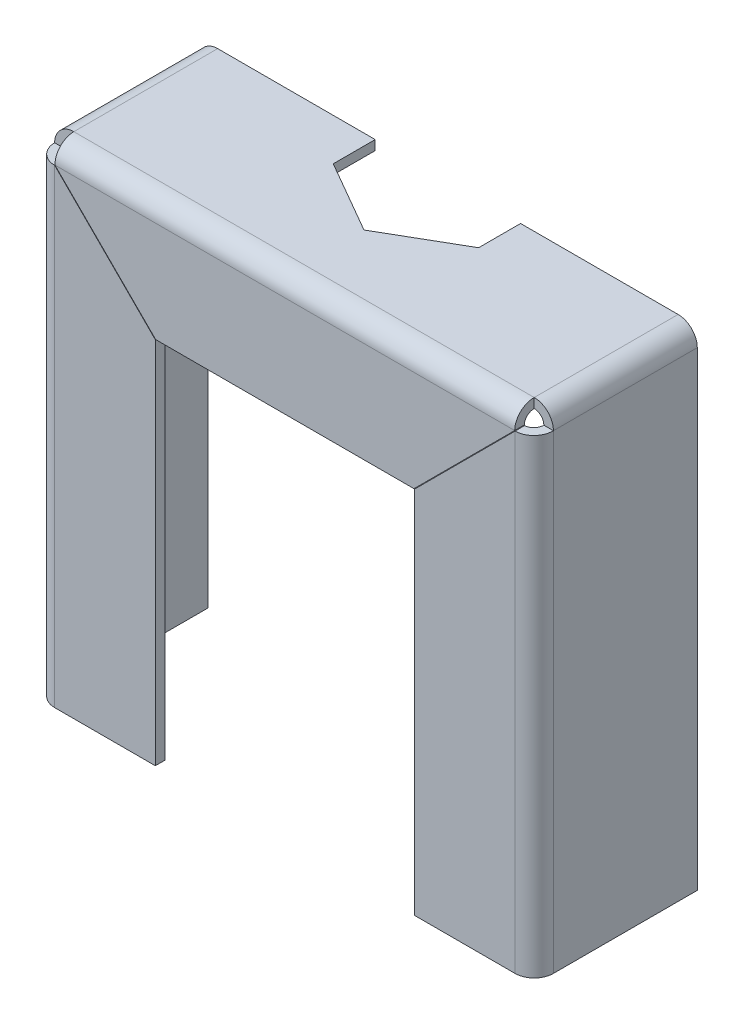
ISO-10303-21;
HEADER;
FILE_DESCRIPTION(('STEP AP214'),'2;1');
FILE_NAME('part.step','',(''),(''),'','','');
FILE_SCHEMA(('AUTOMOTIVE_DESIGN { 1 0 10303 214 1 1 1 1 }'));
ENDSEC;
DATA;
#1=APPLICATION_CONTEXT('core data for automotive mechanical design processes');
#2=APPLICATION_PROTOCOL_DEFINITION('international standard','automotive_design',2000,#1);
#3=PRODUCT_CONTEXT('',#1,'mechanical');
#4=PRODUCT('Part','Part','',(#3));
#5=PRODUCT_RELATED_PRODUCT_CATEGORY('part','',(#4));
#6=PRODUCT_DEFINITION_FORMATION('','',#4);
#7=PRODUCT_DEFINITION_CONTEXT('part definition',#1,'design');
#8=PRODUCT_DEFINITION('design','',#6,#7);
#9=PRODUCT_DEFINITION_SHAPE('','',#8);
#10=(LENGTH_UNIT() NAMED_UNIT(*) SI_UNIT(.MILLI.,.METRE.));
#11=(NAMED_UNIT(*) PLANE_ANGLE_UNIT() SI_UNIT($,.RADIAN.));
#12=(NAMED_UNIT(*) SI_UNIT($,.STERADIAN.) SOLID_ANGLE_UNIT());
#13=UNCERTAINTY_MEASURE_WITH_UNIT(LENGTH_MEASURE(1.E-05),#10,'distance_accuracy_value','');
#14=(GEOMETRIC_REPRESENTATION_CONTEXT(3) GLOBAL_UNCERTAINTY_ASSIGNED_CONTEXT((#13)) GLOBAL_UNIT_ASSIGNED_CONTEXT((#10,
#11,#12)) REPRESENTATION_CONTEXT('',''));
#15=CARTESIAN_POINT('',(0.,0.,0.));
#16=DIRECTION('',(0.,0.,1.));
#17=DIRECTION('',(1.,0.,0.));
#18=AXIS2_PLACEMENT_3D('',#15,#16,#17);
#19=CARTESIAN_POINT('',(-52.,-2.,0.));
#20=DIRECTION('',(0.,0.,-1.));
#21=DIRECTION('',(-1.,0.,0.));
#22=AXIS2_PLACEMENT_3D('',#19,#20,#21);
#23=PLANE('',#22);
#24=DIRECTION('',(0.,-1.,0.));
#25=VECTOR('',#24,1.);
#26=CARTESIAN_POINT('',(15.1560146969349,-2.,0.));
#27=LINE('',#26,#25);
#28=CARTESIAN_POINT('',(15.156014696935,2.,0.));
#29=VERTEX_POINT('',#28);
#30=CARTESIAN_POINT('',(15.156014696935,0.,0.));
#31=VERTEX_POINT('',#30);
#32=EDGE_CURVE('E332',#29,#31,#27,.T.);
#33=ORIENTED_EDGE('',*,*,#32,.F.);
#34=DIRECTION('',(1.,0.,0.));
#35=VECTOR('',#34,1.);
#36=CARTESIAN_POINT('',(0.,2.,0.));
#37=LINE('',#36,#35);
#38=CARTESIAN_POINT('',(48.,2.,0.));
#39=VERTEX_POINT('',#38);
#40=EDGE_CURVE('E609',#39,#29,#37,.F.);
#41=ORIENTED_EDGE('',*,*,#40,.F.);
#42=DIRECTION('',(0.,1.,0.));
#43=VECTOR('',#42,1.);
#44=CARTESIAN_POINT('',(48.,0.,0.));
#45=LINE('',#44,#43);
#46=CARTESIAN_POINT('',(48.,0.,0.));
#47=VERTEX_POINT('',#46);
#48=EDGE_CURVE('E695',#47,#39,#45,.T.);
#49=ORIENTED_EDGE('',*,*,#48,.F.);
#50=DIRECTION('',(-1.,0.,0.));
#51=VECTOR('',#50,1.);
#52=CARTESIAN_POINT('',(0.,0.,0.));
#53=LINE('',#52,#51);
#54=EDGE_CURVE('E611',#47,#31,#53,.T.);
#55=ORIENTED_EDGE('',*,*,#54,.T.);
#56=EDGE_LOOP('',(#33,#41,#49,#55));
#57=FACE_BOUND('',#56,.T.);
#58=ADVANCED_FACE('F97',(#57),#23,.T.);
#59=CARTESIAN_POINT('',(-50.,-2.,30.));
#60=DIRECTION('',(0.,0.,1.));
#61=DIRECTION('',(1.,0.,0.));
#62=AXIS2_PLACEMENT_3D('',#59,#60,#61);
#63=PLANE('',#62);
#64=DIRECTION('',(-1.,0.,0.));
#65=VECTOR('',#64,1.);
#66=CARTESIAN_POINT('',(-50.,-2.,30.));
#67=LINE('',#66,#65);
#68=CARTESIAN_POINT('',(-50.,-2.,30.));
#69=VERTEX_POINT('',#68);
#70=CARTESIAN_POINT('',(-52.,-2.,30.));
#71=VERTEX_POINT('',#70);
#72=EDGE_CURVE('E105',#69,#71,#67,.T.);
#73=ORIENTED_EDGE('',*,*,#72,.F.);
#74=CARTESIAN_POINT('',(-48.,-2.,30.));
#75=DIRECTION('',(0.,0.,-1.));
#76=DIRECTION('',(-1.,0.,0.));
#77=AXIS2_PLACEMENT_3D('',#74,#75,#76);
#78=CIRCLE('',#77,2.);
#79=CARTESIAN_POINT('',(-48.,0.,30.));
#80=VERTEX_POINT('',#79);
#81=EDGE_CURVE('E710',#80,#69,#78,.F.);
#82=ORIENTED_EDGE('',*,*,#81,.F.);
#83=DIRECTION('',(0.,-1.,0.));
#84=VECTOR('',#83,1.);
#85=CARTESIAN_POINT('',(-48.,2.,30.));
#86=LINE('',#85,#84);
#87=CARTESIAN_POINT('',(-48.,2.00000000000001,30.));
#88=VERTEX_POINT('',#87);
#89=EDGE_CURVE('E644',#88,#80,#86,.T.);
#90=ORIENTED_EDGE('',*,*,#89,.F.);
#91=CARTESIAN_POINT('',(-48.,-2.,30.));
#92=DIRECTION('',(0.,0.,1.));
#93=DIRECTION('',(1.,0.,0.));
#94=AXIS2_PLACEMENT_3D('',#91,#92,#93);
#95=CIRCLE('',#94,4.);
#96=EDGE_CURVE('E121',#88,#71,#95,.T.);
#97=ORIENTED_EDGE('',*,*,#96,.T.);
#98=EDGE_LOOP('',(#73,#82,#90,#97));
#99=FACE_BOUND('',#98,.T.);
#100=ADVANCED_FACE('F99',(#99),#63,.T.);
#101=CARTESIAN_POINT('',(-48.,0.,0.));
#102=DIRECTION('',(0.,0.,-1.));
#103=DIRECTION('',(-1.,0.,0.));
#104=AXIS2_PLACEMENT_3D('',#101,#102,#103);
#105=PLANE('',#104);
#106=DIRECTION('',(0.,1.,0.));
#107=VECTOR('',#106,1.);
#108=CARTESIAN_POINT('',(-48.,0.,0.));
#109=LINE('',#108,#107);
#110=CARTESIAN_POINT('',(-48.,0.,0.));
#111=VERTEX_POINT('',#110);
#112=CARTESIAN_POINT('',(-48.,2.,0.));
#113=VERTEX_POINT('',#112);
#114=EDGE_CURVE('E641',#111,#113,#109,.T.);
#115=ORIENTED_EDGE('',*,*,#114,.F.);
#116=CARTESIAN_POINT('',(-48.,-2.,0.));
#117=DIRECTION('',(0.,0.,-1.));
#118=DIRECTION('',(-1.,0.,0.));
#119=AXIS2_PLACEMENT_3D('',#116,#117,#118);
#120=CIRCLE('',#119,2.);
#121=CARTESIAN_POINT('',(-50.,-2.,0.));
#122=VERTEX_POINT('',#121);
#123=EDGE_CURVE('E727',#111,#122,#120,.F.);
#124=ORIENTED_EDGE('',*,*,#123,.T.);
#125=DIRECTION('',(1.,0.,0.));
#126=VECTOR('',#125,1.);
#127=CARTESIAN_POINT('',(-52.,-2.,0.));
#128=LINE('',#127,#126);
#129=CARTESIAN_POINT('',(-52.,-2.,0.));
#130=VERTEX_POINT('',#129);
#131=EDGE_CURVE('E149',#130,#122,#128,.T.);
#132=ORIENTED_EDGE('',*,*,#131,.F.);
#133=CARTESIAN_POINT('',(-48.,-2.,0.));
#134=DIRECTION('',(0.,0.,1.));
#135=DIRECTION('',(1.,0.,0.));
#136=AXIS2_PLACEMENT_3D('',#133,#134,#135);
#137=CIRCLE('',#136,4.);
#138=EDGE_CURVE('E617',#113,#130,#137,.T.);
#139=ORIENTED_EDGE('',*,*,#138,.F.);
#140=EDGE_LOOP('',(#115,#124,#132,#139));
#141=FACE_BOUND('',#140,.T.);
#142=ADVANCED_FACE('F595',(#141),#105,.T.);
#143=DIRECTION('',(0.,1.,0.));
#144=VECTOR('',#143,1.);
#145=CARTESIAN_POINT('',(-15.156014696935,-2.,0.));
#146=LINE('',#145,#144);
#147=CARTESIAN_POINT('',(-15.156014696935,0.,0.));
#148=VERTEX_POINT('',#147);
#149=CARTESIAN_POINT('',(-15.156014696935,2.,0.));
#150=VERTEX_POINT('',#149);
#151=EDGE_CURVE('E329',#148,#150,#146,.T.);
#152=ORIENTED_EDGE('',*,*,#151,.F.);
#153=EDGE_CURVE('E728',#148,#111,#53,.T.);
#154=ORIENTED_EDGE('',*,*,#153,.T.);
#155=ORIENTED_EDGE('',*,*,#114,.T.);
#156=EDGE_CURVE('E618',#150,#113,#37,.F.);
#157=ORIENTED_EDGE('',*,*,#156,.F.);
#158=EDGE_LOOP('',(#152,#154,#155,#157));
#159=FACE_BOUND('',#158,.T.);
#160=ADVANCED_FACE('F592',(#159),#23,.T.);
#161=CARTESIAN_POINT('',(-52.,0.,30.));
#162=DIRECTION('',(1.,0.,0.));
#163=DIRECTION('',(0.,0.,-1.));
#164=AXIS2_PLACEMENT_3D('',#161,#162,#163);
#165=PLANE('',#164);
#166=DIRECTION('',(0.,1.,0.));
#167=VECTOR('',#166,1.);
#168=CARTESIAN_POINT('',(-52.,0.,0.));
#169=LINE('',#168,#167);
#170=CARTESIAN_POINT('',(-52.,-100.,0.));
#171=VERTEX_POINT('',#170);
#172=EDGE_CURVE('E704',#130,#171,#169,.F.);
#173=ORIENTED_EDGE('',*,*,#172,.T.);
#174=DIRECTION('',(0.,0.,-1.));
#175=VECTOR('',#174,1.);
#176=CARTESIAN_POINT('',(-52.,-100.,30.));
#177=LINE('',#176,#175);
#178=CARTESIAN_POINT('',(-52.,-100.,30.));
#179=VERTEX_POINT('',#178);
#180=EDGE_CURVE('E638',#179,#171,#177,.T.);
#181=ORIENTED_EDGE('',*,*,#180,.F.);
#182=DIRECTION('',(0.,1.,0.));
#183=VECTOR('',#182,1.);
#184=CARTESIAN_POINT('',(-52.,0.,30.));
#185=LINE('',#184,#183);
#186=EDGE_CURVE('E620',#71,#179,#185,.F.);
#187=ORIENTED_EDGE('',*,*,#186,.F.);
#188=DIRECTION('',(0.,0.,-1.));
#189=VECTOR('',#188,1.);
#190=CARTESIAN_POINT('',(-52.,-2.,30.));
#191=LINE('',#190,#189);
#192=EDGE_CURVE('E625',#71,#130,#191,.T.);
#193=ORIENTED_EDGE('',*,*,#192,.T.);
#194=EDGE_LOOP('',(#173,#181,#187,#193));
#195=FACE_BOUND('',#194,.T.);
#196=ADVANCED_FACE('F589',(#195),#165,.F.);
#197=CARTESIAN_POINT('',(-50.,-100.,30.));
#198=DIRECTION('',(0.,-1.,0.));
#199=DIRECTION('',(0.,0.,-1.));
#200=AXIS2_PLACEMENT_3D('',#197,#198,#199);
#201=PLANE('',#200);
#202=DIRECTION('',(-1.,0.,0.));
#203=VECTOR('',#202,1.);
#204=CARTESIAN_POINT('',(-50.,-100.,0.));
#205=LINE('',#204,#203);
#206=CARTESIAN_POINT('',(-50.,-100.,0.));
#207=VERTEX_POINT('',#206);
#208=EDGE_CURVE('E722',#207,#171,#205,.T.);
#209=ORIENTED_EDGE('',*,*,#208,.F.);
#210=DIRECTION('',(0.,0.,-1.));
#211=VECTOR('',#210,1.);
#212=CARTESIAN_POINT('',(-50.,-100.,30.));
#213=LINE('',#212,#211);
#214=CARTESIAN_POINT('',(-50.,-100.,30.));
#215=VERTEX_POINT('',#214);
#216=EDGE_CURVE('E156',#215,#207,#213,.T.);
#217=ORIENTED_EDGE('',*,*,#216,.F.);
#218=DIRECTION('',(-1.,0.,0.));
#219=VECTOR('',#218,1.);
#220=CARTESIAN_POINT('',(-50.,-100.,30.));
#221=LINE('',#220,#219);
#222=EDGE_CURVE('E706',#215,#179,#221,.T.);
#223=ORIENTED_EDGE('',*,*,#222,.T.);
#224=ORIENTED_EDGE('',*,*,#180,.T.);
#225=EDGE_LOOP('',(#209,#217,#223,#224));
#226=FACE_BOUND('',#225,.T.);
#227=ADVANCED_FACE('F585',(#226),#201,.T.);
#228=CARTESIAN_POINT('',(-50.,0.,30.));
#229=DIRECTION('',(1.,0.,0.));
#230=DIRECTION('',(0.,0.,-1.));
#231=AXIS2_PLACEMENT_3D('',#228,#229,#230);
#232=PLANE('',#231);
#233=DIRECTION('',(0.,-1.,0.));
#234=VECTOR('',#233,1.);
#235=CARTESIAN_POINT('',(-50.,0.,0.));
#236=LINE('',#235,#234);
#237=EDGE_CURVE('E725',#122,#207,#236,.T.);
#238=ORIENTED_EDGE('',*,*,#237,.F.);
#239=DIRECTION('',(0.,0.,-1.));
#240=VECTOR('',#239,1.);
#241=CARTESIAN_POINT('',(-50.,-2.,30.));
#242=LINE('',#241,#240);
#243=EDGE_CURVE('E634',#69,#122,#242,.T.);
#244=ORIENTED_EDGE('',*,*,#243,.F.);
#245=DIRECTION('',(0.,-1.,0.));
#246=VECTOR('',#245,1.);
#247=CARTESIAN_POINT('',(-50.,0.,30.));
#248=LINE('',#247,#246);
#249=EDGE_CURVE('E708',#69,#215,#248,.T.);
#250=ORIENTED_EDGE('',*,*,#249,.T.);
#251=ORIENTED_EDGE('',*,*,#216,.T.);
#252=EDGE_LOOP('',(#238,#244,#250,#251));
#253=FACE_BOUND('',#252,.T.);
#254=ADVANCED_FACE('F581',(#253),#232,.T.);
#255=CARTESIAN_POINT('',(-48.,-2.,30.));
#256=DIRECTION('',(0.,0.,-1.));
#257=DIRECTION('',(-1.,0.,0.));
#258=AXIS2_PLACEMENT_3D('',#255,#256,#257);
#259=CYLINDRICAL_SURFACE('',#258,2.);
#260=ORIENTED_EDGE('',*,*,#123,.F.);
#261=DIRECTION('',(0.,0.,-1.));
#262=VECTOR('',#261,1.);
#263=CARTESIAN_POINT('',(-48.,0.,30.));
#264=LINE('',#263,#262);
#265=EDGE_CURVE('E631',#80,#111,#264,.T.);
#266=ORIENTED_EDGE('',*,*,#265,.F.);
#267=ORIENTED_EDGE('',*,*,#81,.T.);
#268=ORIENTED_EDGE('',*,*,#243,.T.);
#269=EDGE_LOOP('',(#260,#266,#267,#268));
#270=FACE_BOUND('',#269,.T.);
#271=ADVANCED_FACE('F577',(#270),#259,.F.);
#272=CARTESIAN_POINT('',(0.,0.,30.));
#273=DIRECTION('',(0.,-1.,0.));
#274=DIRECTION('',(0.,0.,-1.));
#275=AXIS2_PLACEMENT_3D('',#272,#273,#274);
#276=PLANE('',#275);
#277=DIRECTION('',(0.,0.,1.));
#278=VECTOR('',#277,1.);
#279=CARTESIAN_POINT('',(15.156014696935,0.,-8.75032916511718));
#280=LINE('',#279,#278);
#281=CARTESIAN_POINT('',(15.1560146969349,0.,8.7503291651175));
#282=VERTEX_POINT('',#281);
#283=EDGE_CURVE('E317',#31,#282,#280,.T.);
#284=ORIENTED_EDGE('',*,*,#283,.F.);
#285=ORIENTED_EDGE('',*,*,#54,.F.);
#286=DIRECTION('',(0.,0.,-1.));
#287=VECTOR('',#286,1.);
#288=CARTESIAN_POINT('',(48.,0.,30.));
#289=LINE('',#288,#287);
#290=CARTESIAN_POINT('',(48.,0.,30.));
#291=VERTEX_POINT('',#290);
#292=EDGE_CURVE('E681',#291,#47,#289,.T.);
#293=ORIENTED_EDGE('',*,*,#292,.F.);
#294=DIRECTION('',(-1.,0.,0.));
#295=VECTOR('',#294,1.);
#296=CARTESIAN_POINT('',(0.,0.,30.));
#297=LINE('',#296,#295);
#298=EDGE_CURVE('E713',#291,#80,#297,.T.);
#299=ORIENTED_EDGE('',*,*,#298,.T.);
#300=ORIENTED_EDGE('',*,*,#265,.T.);
#301=ORIENTED_EDGE('',*,*,#153,.F.);
#302=DIRECTION('',(0.,0.,-1.));
#303=VECTOR('',#302,1.);
#304=CARTESIAN_POINT('',(-15.156014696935,0.,8.75032916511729));
#305=LINE('',#304,#303);
#306=CARTESIAN_POINT('',(-15.156014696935,0.,8.75032916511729));
#307=VERTEX_POINT('',#306);
#308=EDGE_CURVE('E319',#307,#148,#305,.T.);
#309=ORIENTED_EDGE('',*,*,#308,.F.);
#310=DIRECTION('',(-0.866025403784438,0.,-0.500000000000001));
#311=VECTOR('',#310,1.);
#312=CARTESIAN_POINT('',(0.,0.,17.5006583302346));
#313=LINE('',#312,#311);
#314=CARTESIAN_POINT('',(0.,0.,17.5006583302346));
#315=VERTEX_POINT('',#314);
#316=EDGE_CURVE('E324',#315,#307,#313,.T.);
#317=ORIENTED_EDGE('',*,*,#316,.F.);
#318=DIRECTION('',(-0.866025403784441,0.,0.499999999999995));
#319=VECTOR('',#318,1.);
#320=CARTESIAN_POINT('',(15.1560146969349,0.,8.7503291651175));
#321=LINE('',#320,#319);
#322=EDGE_CURVE('E304',#282,#315,#321,.T.);
#323=ORIENTED_EDGE('',*,*,#322,.F.);
#324=EDGE_LOOP('',(#284,#285,#293,#299,#300,#301,#309,#317,#323));
#325=FACE_BOUND('',#324,.T.);
#326=ADVANCED_FACE('F574',(#325),#276,.T.);
#327=CARTESIAN_POINT('',(0.,2.,30.));
#328=DIRECTION('',(0.,-1.,0.));
#329=DIRECTION('',(0.,0.,-1.));
#330=AXIS2_PLACEMENT_3D('',#327,#328,#329);
#331=PLANE('',#330);
#332=ORIENTED_EDGE('',*,*,#40,.T.);
#333=DIRECTION('',(0.,0.,1.));
#334=VECTOR('',#333,1.);
#335=CARTESIAN_POINT('',(15.1560146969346,2.,30.0000000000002));
#336=LINE('',#335,#334);
#337=CARTESIAN_POINT('',(15.1560146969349,2.,8.7503291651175));
#338=VERTEX_POINT('',#337);
#339=EDGE_CURVE('E13',#29,#338,#336,.T.);
#340=ORIENTED_EDGE('',*,*,#339,.T.);
#341=DIRECTION('',(-0.866025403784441,0.,0.499999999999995));
#342=VECTOR('',#341,1.);
#343=CARTESIAN_POINT('',(15.1560146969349,2.,8.7503291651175));
#344=LINE('',#343,#342);
#345=CARTESIAN_POINT('',(0.,2.,17.5006583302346));
#346=VERTEX_POINT('',#345);
#347=EDGE_CURVE('E302',#338,#346,#344,.T.);
#348=ORIENTED_EDGE('',*,*,#347,.T.);
#349=DIRECTION('',(-0.866025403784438,0.,-0.500000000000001));
#350=VECTOR('',#349,1.);
#351=CARTESIAN_POINT('',(0.,2.,17.5006583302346));
#352=LINE('',#351,#350);
#353=CARTESIAN_POINT('',(-15.156014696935,2.,8.75032916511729));
#354=VERTEX_POINT('',#353);
#355=EDGE_CURVE('E311',#346,#354,#352,.T.);
#356=ORIENTED_EDGE('',*,*,#355,.T.);
#357=DIRECTION('',(0.,0.,-1.));
#358=VECTOR('',#357,1.);
#359=CARTESIAN_POINT('',(-15.156014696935,2.,8.75032916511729));
#360=LINE('',#359,#358);
#361=EDGE_CURVE('E112',#354,#150,#360,.T.);
#362=ORIENTED_EDGE('',*,*,#361,.T.);
#363=ORIENTED_EDGE('',*,*,#156,.T.);
#364=DIRECTION('',(0.,0.,-1.));
#365=VECTOR('',#364,1.);
#366=CARTESIAN_POINT('',(-48.,2.,30.));
#367=LINE('',#366,#365);
#368=EDGE_CURVE('E628',#88,#113,#367,.T.);
#369=ORIENTED_EDGE('',*,*,#368,.F.);
#370=DIRECTION('',(1.,0.,0.));
#371=VECTOR('',#370,1.);
#372=CARTESIAN_POINT('',(0.,2.,30.));
#373=LINE('',#372,#371);
#374=CARTESIAN_POINT('',(48.,2.,30.));
#375=VERTEX_POINT('',#374);
#376=EDGE_CURVE('E716',#375,#88,#373,.F.);
#377=ORIENTED_EDGE('',*,*,#376,.F.);
#378=DIRECTION('',(0.,0.,-1.));
#379=VECTOR('',#378,1.);
#380=CARTESIAN_POINT('',(48.,2.,30.));
#381=LINE('',#380,#379);
#382=EDGE_CURVE('E615',#375,#39,#381,.T.);
#383=ORIENTED_EDGE('',*,*,#382,.T.);
#384=EDGE_LOOP('',(#332,#340,#348,#356,#362,#363,#369,#377,#383));
#385=FACE_BOUND('',#384,.T.);
#386=ADVANCED_FACE('F316',(#385),#331,.F.);
#387=CARTESIAN_POINT('',(-48.,-2.,30.));
#388=DIRECTION('',(0.,0.,-1.));
#389=DIRECTION('',(-1.,0.,0.));
#390=AXIS2_PLACEMENT_3D('',#387,#388,#389);
#391=CYLINDRICAL_SURFACE('',#390,4.);
#392=ORIENTED_EDGE('',*,*,#138,.T.);
#393=ORIENTED_EDGE('',*,*,#192,.F.);
#394=ORIENTED_EDGE('',*,*,#96,.F.);
#395=ORIENTED_EDGE('',*,*,#368,.T.);
#396=EDGE_LOOP('',(#392,#393,#394,#395));
#397=FACE_BOUND('',#396,.T.);
#398=ADVANCED_FACE('F567',(#397),#391,.T.);
#399=CARTESIAN_POINT('',(-48.,-2.,0.));
#400=DIRECTION('',(0.,0.,-1.));
#401=DIRECTION('',(-1.,0.,0.));
#402=AXIS2_PLACEMENT_3D('',#399,#400,#401);
#403=PLANE('',#402);
#404=ORIENTED_EDGE('',*,*,#172,.F.);
#405=ORIENTED_EDGE('',*,*,#131,.T.);
#406=ORIENTED_EDGE('',*,*,#237,.T.);
#407=ORIENTED_EDGE('',*,*,#208,.T.);
#408=EDGE_LOOP('',(#404,#405,#406,#407));
#409=FACE_BOUND('',#408,.T.);
#410=ADVANCED_FACE('F563',(#409),#403,.T.);
#411=CARTESIAN_POINT('',(50.,-2.,30.));
#412=DIRECTION('',(0.,0.,1.));
#413=DIRECTION('',(-1.,0.,0.));
#414=AXIS2_PLACEMENT_3D('',#411,#412,#413);
#415=PLANE('',#414);
#416=DIRECTION('',(1.,0.,0.));
#417=VECTOR('',#416,1.);
#418=CARTESIAN_POINT('',(50.,-2.,30.));
#419=LINE('',#418,#417);
#420=CARTESIAN_POINT('',(50.,-2.,30.));
#421=VERTEX_POINT('',#420);
#422=CARTESIAN_POINT('',(52.,-2.,30.));
#423=VERTEX_POINT('',#422);
#424=EDGE_CURVE('E701',#421,#423,#419,.T.);
#425=ORIENTED_EDGE('',*,*,#424,.T.);
#426=CARTESIAN_POINT('',(48.,-2.,30.));
#427=DIRECTION('',(0.,0.,-1.));
#428=DIRECTION('',(-1.,0.,0.));
#429=AXIS2_PLACEMENT_3D('',#426,#427,#428);
#430=CIRCLE('',#429,4.);
#431=EDGE_CURVE('E667',#375,#423,#430,.T.);
#432=ORIENTED_EDGE('',*,*,#431,.F.);
#433=DIRECTION('',(0.,-1.,0.));
#434=VECTOR('',#433,1.);
#435=CARTESIAN_POINT('',(48.,2.,30.));
#436=LINE('',#435,#434);
#437=EDGE_CURVE('E698',#375,#291,#436,.T.);
#438=ORIENTED_EDGE('',*,*,#437,.T.);
#439=CARTESIAN_POINT('',(48.,-2.,30.));
#440=DIRECTION('',(0.,0.,1.));
#441=DIRECTION('',(1.,0.,0.));
#442=AXIS2_PLACEMENT_3D('',#439,#440,#441);
#443=CIRCLE('',#442,2.);
#444=EDGE_CURVE('E799',#291,#421,#443,.F.);
#445=ORIENTED_EDGE('',*,*,#444,.T.);
#446=EDGE_LOOP('',(#425,#432,#438,#445));
#447=FACE_BOUND('',#446,.T.);
#448=ADVANCED_FACE('F559',(#447),#415,.T.);
#449=CARTESIAN_POINT('',(48.,0.,0.));
#450=DIRECTION('',(0.,0.,-1.));
#451=DIRECTION('',(1.,0.,0.));
#452=AXIS2_PLACEMENT_3D('',#449,#450,#451);
#453=PLANE('',#452);
#454=ORIENTED_EDGE('',*,*,#48,.T.);
#455=CARTESIAN_POINT('',(48.,-2.,0.));
#456=DIRECTION('',(0.,0.,-1.));
#457=DIRECTION('',(-1.,0.,0.));
#458=AXIS2_PLACEMENT_3D('',#455,#456,#457);
#459=CIRCLE('',#458,4.);
#460=CARTESIAN_POINT('',(52.,-2.,0.));
#461=VERTEX_POINT('',#460);
#462=EDGE_CURVE('E674',#39,#461,#459,.T.);
#463=ORIENTED_EDGE('',*,*,#462,.T.);
#464=DIRECTION('',(-1.,0.,0.));
#465=VECTOR('',#464,1.);
#466=CARTESIAN_POINT('',(52.,-2.,0.));
#467=LINE('',#466,#465);
#468=CARTESIAN_POINT('',(50.,-2.,0.));
#469=VERTEX_POINT('',#468);
#470=EDGE_CURVE('E692',#461,#469,#467,.T.);
#471=ORIENTED_EDGE('',*,*,#470,.T.);
#472=CARTESIAN_POINT('',(48.,-2.,0.));
#473=DIRECTION('',(0.,0.,1.));
#474=DIRECTION('',(1.,0.,0.));
#475=AXIS2_PLACEMENT_3D('',#472,#473,#474);
#476=CIRCLE('',#475,2.);
#477=EDGE_CURVE('E671',#47,#469,#476,.F.);
#478=ORIENTED_EDGE('',*,*,#477,.F.);
#479=EDGE_LOOP('',(#454,#463,#471,#478));
#480=FACE_BOUND('',#479,.T.);
#481=ADVANCED_FACE('F555',(#480),#453,.T.);
#482=CARTESIAN_POINT('',(52.,0.,30.));
#483=DIRECTION('',(-1.,0.,0.));
#484=DIRECTION('',(0.,0.,-1.));
#485=AXIS2_PLACEMENT_3D('',#482,#483,#484);
#486=PLANE('',#485);
#487=DIRECTION('',(0.,1.,0.));
#488=VECTOR('',#487,1.);
#489=CARTESIAN_POINT('',(52.,0.,0.));
#490=LINE('',#489,#488);
#491=CARTESIAN_POINT('',(52.,-100.,0.));
#492=VERTEX_POINT('',#491);
#493=EDGE_CURVE('E657',#461,#492,#490,.F.);
#494=ORIENTED_EDGE('',*,*,#493,.F.);
#495=DIRECTION('',(0.,0.,-1.));
#496=VECTOR('',#495,1.);
#497=CARTESIAN_POINT('',(52.,-2.,30.));
#498=LINE('',#497,#496);
#499=EDGE_CURVE('E678',#423,#461,#498,.T.);
#500=ORIENTED_EDGE('',*,*,#499,.F.);
#501=DIRECTION('',(0.,1.,0.));
#502=VECTOR('',#501,1.);
#503=CARTESIAN_POINT('',(52.,0.,30.));
#504=LINE('',#503,#502);
#505=CARTESIAN_POINT('',(52.,-100.,30.));
#506=VERTEX_POINT('',#505);
#507=EDGE_CURVE('E677',#423,#506,#504,.F.);
#508=ORIENTED_EDGE('',*,*,#507,.T.);
#509=DIRECTION('',(0.,0.,-1.));
#510=VECTOR('',#509,1.);
#511=CARTESIAN_POINT('',(52.,-100.,30.));
#512=LINE('',#511,#510);
#513=EDGE_CURVE('E689',#506,#492,#512,.T.);
#514=ORIENTED_EDGE('',*,*,#513,.T.);
#515=EDGE_LOOP('',(#494,#500,#508,#514));
#516=FACE_BOUND('',#515,.T.);
#517=ADVANCED_FACE('F551',(#516),#486,.F.);
#518=CARTESIAN_POINT('',(50.,-100.,30.));
#519=DIRECTION('',(0.,-1.,0.));
#520=DIRECTION('',(0.,0.,-1.));
#521=AXIS2_PLACEMENT_3D('',#518,#519,#520);
#522=PLANE('',#521);
#523=DIRECTION('',(1.,0.,0.));
#524=VECTOR('',#523,1.);
#525=CARTESIAN_POINT('',(50.,-100.,0.));
#526=LINE('',#525,#524);
#527=CARTESIAN_POINT('',(50.,-100.,0.));
#528=VERTEX_POINT('',#527);
#529=EDGE_CURVE('E659',#528,#492,#526,.T.);
#530=ORIENTED_EDGE('',*,*,#529,.T.);
#531=ORIENTED_EDGE('',*,*,#513,.F.);
#532=DIRECTION('',(1.,0.,0.));
#533=VECTOR('',#532,1.);
#534=CARTESIAN_POINT('',(50.,-100.,30.));
#535=LINE('',#534,#533);
#536=CARTESIAN_POINT('',(50.,-100.,30.));
#537=VERTEX_POINT('',#536);
#538=EDGE_CURVE('E802',#537,#506,#535,.T.);
#539=ORIENTED_EDGE('',*,*,#538,.F.);
#540=DIRECTION('',(0.,0.,-1.));
#541=VECTOR('',#540,1.);
#542=CARTESIAN_POINT('',(50.,-100.,30.));
#543=LINE('',#542,#541);
#544=EDGE_CURVE('E686',#537,#528,#543,.T.);
#545=ORIENTED_EDGE('',*,*,#544,.T.);
#546=EDGE_LOOP('',(#530,#531,#539,#545));
#547=FACE_BOUND('',#546,.T.);
#548=ADVANCED_FACE('F547',(#547),#522,.T.);
#549=CARTESIAN_POINT('',(50.,0.,30.));
#550=DIRECTION('',(-1.,0.,0.));
#551=DIRECTION('',(0.,0.,-1.));
#552=AXIS2_PLACEMENT_3D('',#549,#550,#551);
#553=PLANE('',#552);
#554=DIRECTION('',(0.,-1.,0.));
#555=VECTOR('',#554,1.);
#556=CARTESIAN_POINT('',(50.,0.,0.));
#557=LINE('',#556,#555);
#558=EDGE_CURVE('E664',#469,#528,#557,.T.);
#559=ORIENTED_EDGE('',*,*,#558,.T.);
#560=ORIENTED_EDGE('',*,*,#544,.F.);
#561=DIRECTION('',(0.,-1.,0.));
#562=VECTOR('',#561,1.);
#563=CARTESIAN_POINT('',(50.,0.,30.));
#564=LINE('',#563,#562);
#565=EDGE_CURVE('E801',#421,#537,#564,.T.);
#566=ORIENTED_EDGE('',*,*,#565,.F.);
#567=DIRECTION('',(0.,0.,-1.));
#568=VECTOR('',#567,1.);
#569=CARTESIAN_POINT('',(50.,-2.,30.));
#570=LINE('',#569,#568);
#571=EDGE_CURVE('E684',#421,#469,#570,.T.);
#572=ORIENTED_EDGE('',*,*,#571,.T.);
#573=EDGE_LOOP('',(#559,#560,#566,#572));
#574=FACE_BOUND('',#573,.T.);
#575=ADVANCED_FACE('F543',(#574),#553,.T.);
#576=CARTESIAN_POINT('',(48.,-2.,30.));
#577=DIRECTION('',(0.,0.,-1.));
#578=DIRECTION('',(1.,0.,0.));
#579=AXIS2_PLACEMENT_3D('',#576,#577,#578);
#580=CYLINDRICAL_SURFACE('',#579,2.);
#581=ORIENTED_EDGE('',*,*,#477,.T.);
#582=ORIENTED_EDGE('',*,*,#571,.F.);
#583=ORIENTED_EDGE('',*,*,#444,.F.);
#584=ORIENTED_EDGE('',*,*,#292,.T.);
#585=EDGE_LOOP('',(#581,#582,#583,#584));
#586=FACE_BOUND('',#585,.T.);
#587=ADVANCED_FACE('F539',(#586),#580,.F.);
#588=CARTESIAN_POINT('',(48.,-2.,30.));
#589=DIRECTION('',(0.,0.,-1.));
#590=DIRECTION('',(1.,0.,0.));
#591=AXIS2_PLACEMENT_3D('',#588,#589,#590);
#592=CYLINDRICAL_SURFACE('',#591,4.);
#593=ORIENTED_EDGE('',*,*,#462,.F.);
#594=ORIENTED_EDGE('',*,*,#382,.F.);
#595=ORIENTED_EDGE('',*,*,#431,.T.);
#596=ORIENTED_EDGE('',*,*,#499,.T.);
#597=EDGE_LOOP('',(#593,#594,#595,#596));
#598=FACE_BOUND('',#597,.T.);
#599=ADVANCED_FACE('F535',(#598),#592,.T.);
#600=CARTESIAN_POINT('',(48.,-2.,0.));
#601=DIRECTION('',(0.,0.,-1.));
#602=DIRECTION('',(1.,0.,0.));
#603=AXIS2_PLACEMENT_3D('',#600,#601,#602);
#604=PLANE('',#603);
#605=ORIENTED_EDGE('',*,*,#493,.T.);
#606=ORIENTED_EDGE('',*,*,#529,.F.);
#607=ORIENTED_EDGE('',*,*,#558,.F.);
#608=ORIENTED_EDGE('',*,*,#470,.F.);
#609=EDGE_LOOP('',(#605,#606,#607,#608));
#610=FACE_BOUND('',#609,.T.);
#611=ADVANCED_FACE('F523',(#610),#604,.T.);
#612=CARTESIAN_POINT('',(-52.02,-2.,30.));
#613=CARTESIAN_POINT('',(-52.02,-2.00589361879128,30.5263116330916));
#614=CARTESIAN_POINT('',(-51.9153701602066,-2.01178511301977,31.0522264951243));
#615=CARTESIAN_POINT('',(-51.5126212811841,-2.02357022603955,32.024548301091));
#616=CARTESIAN_POINT('',(-51.2146607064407,-2.02946278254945,32.4704778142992));
#617=CARTESIAN_POINT('',(-50.4704778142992,-2.04124789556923,33.2146607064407));
#618=CARTESIAN_POINT('',(-50.024548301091,-2.04714045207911,33.5126212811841));
#619=CARTESIAN_POINT('',(-49.0522264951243,-2.05892556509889,33.9153701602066));
#620=CARTESIAN_POINT('',(-48.5263116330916,-2.0648170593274,34.02));
#621=CARTESIAN_POINT('',(-48.,-2.07071067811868,34.02));
#622=CARTESIAN_POINT('',(-52.,-2.,30.));
#623=CARTESIAN_POINT('',(-52.,-2.00589361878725,30.523693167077));
#624=CARTESIAN_POINT('',(-51.8958907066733,-2.01178511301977,31.0469915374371));
#625=CARTESIAN_POINT('',(-51.495145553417,-2.02357022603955,32.0144759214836));
#626=CARTESIAN_POINT('',(-51.1986673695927,-2.02946278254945,32.4581868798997));
#627=CARTESIAN_POINT('',(-50.4581868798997,-2.04124789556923,33.1986673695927));
#628=CARTESIAN_POINT('',(-50.0144759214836,-2.04714045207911,33.495145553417));
#629=CARTESIAN_POINT('',(-49.0469915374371,-2.05892556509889,33.8958907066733));
#630=CARTESIAN_POINT('',(-48.523693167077,-2.06481705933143,34.));
#631=CARTESIAN_POINT('',(-48.,-2.07071067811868,34.));
#632=CARTESIAN_POINT('',(-50.,-2.,30.));
#633=CARTESIAN_POINT('',(-50.,-2.00589361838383,30.2618465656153));
#634=CARTESIAN_POINT('',(-49.9479453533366,-2.01178511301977,30.5234957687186));
#635=CARTESIAN_POINT('',(-49.7475727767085,-2.02357022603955,31.0072379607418));
#636=CARTESIAN_POINT('',(-49.5993336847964,-2.02946278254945,31.2290934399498));
#637=CARTESIAN_POINT('',(-49.2290934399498,-2.04124789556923,31.5993336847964));
#638=CARTESIAN_POINT('',(-49.0072379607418,-2.04714045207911,31.7475727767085));
#639=CARTESIAN_POINT('',(-48.5234957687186,-2.05892556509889,31.9479453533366));
#640=CARTESIAN_POINT('',(-48.2618465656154,-2.06481705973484,32.));
#641=CARTESIAN_POINT('',(-48.,-2.07071067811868,32.));
#642=CARTESIAN_POINT('',(-49.9798,-2.,30.));
#643=CARTESIAN_POINT('',(-49.9798,-2.00589361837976,30.2592019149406));
#644=CARTESIAN_POINT('',(-49.9282711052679,-2.01178511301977,30.5182084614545));
#645=CARTESIAN_POINT('',(-49.7299222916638,-2.02357022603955,30.9970648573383));
#646=CARTESIAN_POINT('',(-49.5831804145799,-2.02946278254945,31.2166795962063));
#647=CARTESIAN_POINT('',(-49.2166795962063,-2.04124789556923,31.5831804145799));
#648=CARTESIAN_POINT('',(-48.9970648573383,-2.04714045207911,31.7299222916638));
#649=CARTESIAN_POINT('',(-48.5182084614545,-2.05892556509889,31.9282711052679));
#650=CARTESIAN_POINT('',(-48.2592019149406,-2.06481705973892,31.9798));
#651=CARTESIAN_POINT('',(-48.,-2.07071067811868,31.9798));
#652=B_SPLINE_SURFACE_WITH_KNOTS('',1,3,((#612,#613,#614,#615,#616,#617,#618,#619,#620,#621),
(#622,#623,#624,#625,#626,#627,#628,#629,#630,#631),(#632,#633,#634,#635,#636,#637,#638,#639,
#640,#641),(#642,#643,#644,#645,#646,#647,#648,#649,#650,#651)),.UNSPECIFIED.,.F.,.F.,.F.,(2,1,
1,2),(4,2,2,2,4),(-0.01,0.,1.,1.0101),(0.,0.25,0.5,0.75,1.),.UNSPECIFIED.);
#653=DIRECTION('',(0.,0.,-1.));
#654=VECTOR('',#653,1.);
#655=CARTESIAN_POINT('',(-48.,-2.07071067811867,32.));
#656=LINE('',#655,#654);
#657=CARTESIAN_POINT('',(-48.,-2.07071067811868,34.));
#658=VERTEX_POINT('',#657);
#659=CARTESIAN_POINT('',(-48.,-2.07071067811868,32.));
#660=VERTEX_POINT('',#659);
#661=EDGE_CURVE('E467',#658,#660,#656,.T.);
#662=CARTESIAN_POINT('',(-50.,-2.,30.));
#663=CARTESIAN_POINT('',(-50.0000006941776,-2.00073656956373,30.0327249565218));
#664=CARTESIAN_POINT('',(-49.9991968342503,-2.00147313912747,30.0654498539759));
#665=CARTESIAN_POINT('',(-49.9959849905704,-2.00294627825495,30.1308208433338));
#666=CARTESIAN_POINT('',(-49.9935770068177,-2.00368284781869,30.1634669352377));
#667=CARTESIAN_POINT('',(-49.9871618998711,-2.00515598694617,30.2286016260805));
#668=CARTESIAN_POINT('',(-49.9831547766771,-2.0058925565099,30.2610902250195));
#669=CARTESIAN_POINT('',(-49.973551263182,-2.00736569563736,30.325831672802));
#670=CARTESIAN_POINT('',(-49.9679548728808,-2.00810226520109,30.3580845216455));
#671=CARTESIAN_POINT('',(-49.9551862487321,-2.00957540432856,30.422276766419));
#672=CARTESIAN_POINT('',(-49.9480140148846,-2.01031197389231,30.4542161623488));
#673=CARTESIAN_POINT('',(-49.9321109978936,-2.01178511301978,30.5177045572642));
#674=CARTESIAN_POINT('',(-49.9233802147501,-2.01252168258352,30.5492535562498));
#675=CARTESIAN_POINT('',(-49.9043811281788,-2.01399482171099,30.611885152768));
#676=CARTESIAN_POINT('',(-49.8941128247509,-2.01473139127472,30.6429677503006));
#677=CARTESIAN_POINT('',(-49.8720634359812,-2.01620453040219,30.7045916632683));
#678=CARTESIAN_POINT('',(-49.8602823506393,-2.01694109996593,30.7351329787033));
#679=CARTESIAN_POINT('',(-49.8352357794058,-2.0184142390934,30.795600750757));
#680=CARTESIAN_POINT('',(-49.8219702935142,-2.01915080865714,30.8255272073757));
#681=CARTESIAN_POINT('',(-49.7939868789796,-2.02062394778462,30.8846931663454));
#682=CARTESIAN_POINT('',(-49.7792689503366,-2.02136051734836,30.9139326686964));
#683=CARTESIAN_POINT('',(-49.7484161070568,-2.02283365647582,30.9716542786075));
#684=CARTESIAN_POINT('',(-49.73228119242,-2.02357022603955,31.0001363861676));
#685=CARTESIAN_POINT('',(-49.6986332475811,-2.02504336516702,31.0562745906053));
#686=CARTESIAN_POINT('',(-49.6811202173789,-2.02577993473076,31.0839306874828));
#687=CARTESIAN_POINT('',(-49.6447582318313,-2.02725307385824,31.1383502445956));
#688=CARTESIAN_POINT('',(-49.6259092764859,-2.02798964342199,31.1651137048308));
#689=CARTESIAN_POINT('',(-49.5869208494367,-2.02946278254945,31.2176835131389));
#690=CARTESIAN_POINT('',(-49.5667813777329,-2.03019935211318,31.2434898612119));
#691=CARTESIAN_POINT('',(-49.5252604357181,-2.03167249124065,31.2940832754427));
#692=CARTESIAN_POINT('',(-49.5038789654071,-2.03240906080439,31.3188703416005));
#693=CARTESIAN_POINT('',(-49.4599255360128,-2.03388219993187,31.3673654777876));
#694=CARTESIAN_POINT('',(-49.4373535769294,-2.03461876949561,31.3910735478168));
#695=CARTESIAN_POINT('',(-49.3910735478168,-2.03609190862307,31.4373535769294));
#696=CARTESIAN_POINT('',(-49.3673654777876,-2.03682847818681,31.4599255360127));
#697=CARTESIAN_POINT('',(-49.3188703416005,-2.03830161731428,31.5038789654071));
#698=CARTESIAN_POINT('',(-49.2940832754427,-2.03903818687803,31.5252604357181));
#699=CARTESIAN_POINT('',(-49.2434898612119,-2.0405113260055,31.5667813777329));
#700=CARTESIAN_POINT('',(-49.217683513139,-2.04124789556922,31.5869208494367));
#701=CARTESIAN_POINT('',(-49.1651137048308,-2.04272103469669,31.6259092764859));
#702=CARTESIAN_POINT('',(-49.1383502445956,-2.04345760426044,31.6447582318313));
#703=CARTESIAN_POINT('',(-49.0839306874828,-2.04493074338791,31.6811202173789));
#704=CARTESIAN_POINT('',(-49.0562745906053,-2.04566731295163,31.6986332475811));
#705=CARTESIAN_POINT('',(-49.0001363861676,-2.0471404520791,31.73228119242));
#706=CARTESIAN_POINT('',(-48.9716542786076,-2.04787702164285,31.7484161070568));
#707=CARTESIAN_POINT('',(-48.9139326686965,-2.04935016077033,31.7792689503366));
#708=CARTESIAN_POINT('',(-48.8846931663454,-2.05008673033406,31.7939868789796));
#709=CARTESIAN_POINT('',(-48.8255272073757,-2.05155986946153,31.8219702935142));
#710=CARTESIAN_POINT('',(-48.795600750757,-2.05229643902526,31.8352357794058));
#711=CARTESIAN_POINT('',(-48.7351329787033,-2.05376957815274,31.8602823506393));
#712=CARTESIAN_POINT('',(-48.7045916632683,-2.05450614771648,31.8720634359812));
#713=CARTESIAN_POINT('',(-48.6429677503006,-2.05597928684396,31.8941128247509));
#714=CARTESIAN_POINT('',(-48.611885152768,-2.05671585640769,31.9043811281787));
#715=CARTESIAN_POINT('',(-48.5492535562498,-2.05818899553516,31.9233802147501));
#716=CARTESIAN_POINT('',(-48.5177045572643,-2.0589255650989,31.9321109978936));
#717=CARTESIAN_POINT('',(-48.4542161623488,-2.06039870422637,31.9480140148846));
#718=CARTESIAN_POINT('',(-48.422276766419,-2.0611352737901,31.9551862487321));
#719=CARTESIAN_POINT('',(-48.3580845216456,-2.06260841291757,31.9679548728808));
#720=CARTESIAN_POINT('',(-48.325831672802,-2.06334498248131,31.973551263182));
#721=CARTESIAN_POINT('',(-48.2610902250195,-2.06481812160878,31.9831547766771));
#722=CARTESIAN_POINT('',(-48.2286016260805,-2.06555469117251,31.9871618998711));
#723=CARTESIAN_POINT('',(-48.1634669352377,-2.06702783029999,31.9935770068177));
#724=CARTESIAN_POINT('',(-48.1308208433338,-2.06776439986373,31.9959849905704));
#725=CARTESIAN_POINT('',(-48.0654498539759,-2.06923753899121,31.9991968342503));
#726=CARTESIAN_POINT('',(-48.0327249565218,-2.06997410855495,32.0000006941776));
#727=CARTESIAN_POINT('',(-48.,-2.07071067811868,32.));
#728=B_SPLINE_CURVE_WITH_KNOTS('',3,(#662,#663,#664,#665,#666,#667,#668,#669,#670,#671,#672,
#673,#674,#675,#676,#677,#678,#679,#680,#681,#682,#683,#684,#685,#686,#687,#688,#689,#690,#691,
#692,#693,#694,#695,#696,#697,#698,#699,#700,#701,#702,#703,#704,#705,#706,#707,#708,#709,#710,
#711,#712,#713,#714,#715,#716,#717,#718,#719,#720,#721,#722,#723,#724,#725,#726,#727),
.UNSPECIFIED.,.F.,.F.,(4,2,2,2,2,2,2,2,2,2,2,2,2,2,2,2,2,2,2,2,2,2,2,2,2,2,2,2,2,2,2,2,4),(0.,
0.0981897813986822,0.196379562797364,0.294569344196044,0.392759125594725,0.490948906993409,
0.58913868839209,0.68732846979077,0.785518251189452,0.883708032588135,0.981897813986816,
1.0800875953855,1.17827737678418,1.27646715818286,1.37465693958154,1.47284672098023,
1.57103650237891,1.66922628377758,1.76741606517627,1.86560584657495,1.96379562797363,
2.06198540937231,2.16017519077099,2.25836497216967,2.35655475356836,2.45474453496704,
2.55293431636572,2.6511240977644,2.74931387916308,2.84750366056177,2.94569344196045,
3.04388322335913,3.14207300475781),.UNSPECIFIED.);
#729=EDGE_CURVE('E493',#69,#660,#728,.T.);
#730=CARTESIAN_POINT('',(-52.,-2.,30.));
#731=CARTESIAN_POINT('',(-52.0000013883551,-2.00073656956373,30.0654499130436));
#732=CARTESIAN_POINT('',(-51.9983936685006,-2.00147313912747,30.1308997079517));
#733=CARTESIAN_POINT('',(-51.9919699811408,-2.00294627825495,30.2616416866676));
#734=CARTESIAN_POINT('',(-51.9871540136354,-2.00368284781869,30.3269338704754));
#735=CARTESIAN_POINT('',(-51.9743237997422,-2.00515598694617,30.4572032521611));
#736=CARTESIAN_POINT('',(-51.9663095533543,-2.0058925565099,30.5221804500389));
#737=CARTESIAN_POINT('',(-51.947102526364,-2.00736569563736,30.651663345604));
#738=CARTESIAN_POINT('',(-51.9359097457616,-2.00810226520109,30.7161690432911));
#739=CARTESIAN_POINT('',(-51.9103724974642,-2.00957540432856,30.8445535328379));
#740=CARTESIAN_POINT('',(-51.8960280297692,-2.01031197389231,30.9084323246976));
#741=CARTESIAN_POINT('',(-51.8642219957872,-2.01178511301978,31.0354091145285));
#742=CARTESIAN_POINT('',(-51.8467604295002,-2.01252168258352,31.0985071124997));
#743=CARTESIAN_POINT('',(-51.8087622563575,-2.01399482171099,31.223770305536));
#744=CARTESIAN_POINT('',(-51.7882256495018,-2.01473139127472,31.2859355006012));
#745=CARTESIAN_POINT('',(-51.7441268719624,-2.01620453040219,31.4091833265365));
#746=CARTESIAN_POINT('',(-51.7205647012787,-2.01694109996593,31.4702659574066));
#747=CARTESIAN_POINT('',(-51.6704715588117,-2.0184142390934,31.5912015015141));
#748=CARTESIAN_POINT('',(-51.6439405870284,-2.01915080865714,31.6510544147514));
#749=CARTESIAN_POINT('',(-51.5879737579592,-2.02062394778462,31.7693863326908));
#750=CARTESIAN_POINT('',(-51.5585379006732,-2.02136051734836,31.8278653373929));
#751=CARTESIAN_POINT('',(-51.4968322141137,-2.02283365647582,31.9433085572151));
#752=CARTESIAN_POINT('',(-51.4645623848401,-2.02357022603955,32.0002727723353));
#753=CARTESIAN_POINT('',(-51.3972664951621,-2.02504336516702,32.1125491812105));
#754=CARTESIAN_POINT('',(-51.3622404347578,-2.02577993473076,32.1678613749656));
#755=CARTESIAN_POINT('',(-51.2895164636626,-2.02725307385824,32.2767004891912));
#756=CARTESIAN_POINT('',(-51.2518185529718,-2.02798964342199,32.3302274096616));
#757=CARTESIAN_POINT('',(-51.1738416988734,-2.02946278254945,32.4353670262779));
#758=CARTESIAN_POINT('',(-51.1335627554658,-2.03019935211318,32.4869797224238));
#759=CARTESIAN_POINT('',(-51.0505208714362,-2.03167249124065,32.5881665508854));
#760=CARTESIAN_POINT('',(-51.0077579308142,-2.03240906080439,32.637740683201));
#761=CARTESIAN_POINT('',(-50.9198510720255,-2.03388219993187,32.7347309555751));
#762=CARTESIAN_POINT('',(-50.8747071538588,-2.03461876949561,32.7821470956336));
#763=CARTESIAN_POINT('',(-50.7821470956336,-2.03609190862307,32.8747071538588));
#764=CARTESIAN_POINT('',(-50.7347309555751,-2.0368284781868,32.9198510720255));
#765=CARTESIAN_POINT('',(-50.637740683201,-2.03830161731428,33.0077579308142));
#766=CARTESIAN_POINT('',(-50.5881665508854,-2.03903818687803,33.0505208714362));
#767=CARTESIAN_POINT('',(-50.4869797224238,-2.0405113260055,33.1335627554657));
#768=CARTESIAN_POINT('',(-50.4353670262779,-2.04124789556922,33.1738416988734));
#769=CARTESIAN_POINT('',(-50.3302274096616,-2.04272103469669,33.2518185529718));
#770=CARTESIAN_POINT('',(-50.2767004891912,-2.04345760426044,33.2895164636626));
#771=CARTESIAN_POINT('',(-50.1678613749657,-2.04493074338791,33.3622404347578));
#772=CARTESIAN_POINT('',(-50.1125491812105,-2.04566731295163,33.3972664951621));
#773=CARTESIAN_POINT('',(-50.0002727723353,-2.0471404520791,33.4645623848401));
#774=CARTESIAN_POINT('',(-49.9433085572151,-2.04787702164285,33.4968322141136));
#775=CARTESIAN_POINT('',(-49.8278653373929,-2.04935016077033,33.5585379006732));
#776=CARTESIAN_POINT('',(-49.7693863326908,-2.05008673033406,33.5879737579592));
#777=CARTESIAN_POINT('',(-49.6510544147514,-2.05155986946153,33.6439405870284));
#778=CARTESIAN_POINT('',(-49.5912015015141,-2.05229643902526,33.6704715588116));
#779=CARTESIAN_POINT('',(-49.4702659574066,-2.05376957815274,33.7205647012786));
#780=CARTESIAN_POINT('',(-49.4091833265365,-2.05450614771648,33.7441268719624));
#781=CARTESIAN_POINT('',(-49.2859355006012,-2.05597928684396,33.7882256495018));
#782=CARTESIAN_POINT('',(-49.223770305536,-2.05671585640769,33.8087622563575));
#783=CARTESIAN_POINT('',(-49.0985071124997,-2.05818899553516,33.8467604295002));
#784=CARTESIAN_POINT('',(-49.0354091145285,-2.0589255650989,33.8642219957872));
#785=CARTESIAN_POINT('',(-48.9084323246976,-2.06039870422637,33.8960280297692));
#786=CARTESIAN_POINT('',(-48.8445535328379,-2.0611352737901,33.9103724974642));
#787=CARTESIAN_POINT('',(-48.7161690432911,-2.06260841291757,33.9359097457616));
#788=CARTESIAN_POINT('',(-48.651663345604,-2.06334498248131,33.947102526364));
#789=CARTESIAN_POINT('',(-48.5221804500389,-2.06481812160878,33.9663095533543));
#790=CARTESIAN_POINT('',(-48.4572032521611,-2.06555469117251,33.9743237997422));
#791=CARTESIAN_POINT('',(-48.3269338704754,-2.06702783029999,33.9871540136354));
#792=CARTESIAN_POINT('',(-48.2616416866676,-2.06776439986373,33.9919699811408));
#793=CARTESIAN_POINT('',(-48.1308997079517,-2.06923753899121,33.9983936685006));
#794=CARTESIAN_POINT('',(-48.0654499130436,-2.06997410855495,34.0000013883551));
#795=CARTESIAN_POINT('',(-48.,-2.07071067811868,34.));
#796=B_SPLINE_CURVE_WITH_KNOTS('',3,(#730,#731,#732,#733,#734,#735,#736,#737,#738,#739,#740,
#741,#742,#743,#744,#745,#746,#747,#748,#749,#750,#751,#752,#753,#754,#755,#756,#757,#758,#759,
#760,#761,#762,#763,#764,#765,#766,#767,#768,#769,#770,#771,#772,#773,#774,#775,#776,#777,#778,
#779,#780,#781,#782,#783,#784,#785,#786,#787,#788,#789,#790,#791,#792,#793,#794,#795),
.UNSPECIFIED.,.F.,.F.,(4,2,2,2,2,2,2,2,2,2,2,2,2,2,2,2,2,2,2,2,2,2,2,2,2,2,2,2,2,2,2,2,4),(0.,
0.196342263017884,0.392684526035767,0.589026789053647,0.785369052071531,0.981711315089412,
1.1780535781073,1.37439584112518,1.57073810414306,1.76708036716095,1.96342263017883,
2.15976489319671,2.35610715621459,2.55244941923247,2.74879168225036,2.94513394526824,
3.14147620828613,3.33781847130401,3.53416073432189,3.73050299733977,3.92684526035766,
4.12318752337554,4.31952978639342,4.5158720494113,4.71221431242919,4.90855657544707,
5.10489883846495,5.30124110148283,5.49758336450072,5.6939256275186,5.89026789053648,
6.08661015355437,6.28295241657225),.UNSPECIFIED.);
#797=EDGE_CURVE('E492',#71,#658,#796,.T.);
#798=ORIENTED_EDGE('',*,*,#661,.T.);
#799=ORIENTED_EDGE('',*,*,#729,.F.);
#800=ORIENTED_EDGE('',*,*,#72,.T.);
#801=ORIENTED_EDGE('',*,*,#797,.T.);
#802=EDGE_LOOP('',(#798,#799,#800,#801));
#803=FACE_BOUND('',#802,.T.);
#804=ADVANCED_FACE('F517',(#803),#652,.F.);
#805=CARTESIAN_POINT('',(-48.,-100.,30.));
#806=DIRECTION('',(0.,1.,0.));
#807=DIRECTION('',(0.,0.,1.));
#808=AXIS2_PLACEMENT_3D('',#805,#806,#807);
#809=PLANE('',#808);
#810=CARTESIAN_POINT('',(-48.,-100.,30.));
#811=DIRECTION('',(0.,-1.,0.));
#812=DIRECTION('',(0.,0.,-1.));
#813=AXIS2_PLACEMENT_3D('',#810,#811,#812);
#814=CIRCLE('',#813,2.);
#815=CARTESIAN_POINT('',(-48.,-100.,32.));
#816=VERTEX_POINT('',#815);
#817=EDGE_CURVE('E469',#816,#215,#814,.T.);
#818=ORIENTED_EDGE('',*,*,#817,.F.);
#819=DIRECTION('',(0.,0.,-1.));
#820=VECTOR('',#819,1.);
#821=CARTESIAN_POINT('',(-48.,-100.,32.));
#822=LINE('',#821,#820);
#823=CARTESIAN_POINT('',(-48.,-100.,34.));
#824=VERTEX_POINT('',#823);
#825=EDGE_CURVE('E485',#816,#824,#822,.F.);
#826=ORIENTED_EDGE('',*,*,#825,.T.);
#827=CARTESIAN_POINT('',(-48.,-100.,30.));
#828=DIRECTION('',(0.,-1.,0.));
#829=DIRECTION('',(0.,0.,-1.));
#830=AXIS2_PLACEMENT_3D('',#827,#828,#829);
#831=CIRCLE('',#830,4.);
#832=EDGE_CURVE('E489',#824,#179,#831,.T.);
#833=ORIENTED_EDGE('',*,*,#832,.T.);
#834=ORIENTED_EDGE('',*,*,#222,.F.);
#835=EDGE_LOOP('',(#818,#826,#833,#834));
#836=FACE_BOUND('',#835,.T.);
#837=ADVANCED_FACE('F522',(#836),#809,.F.);
#838=CARTESIAN_POINT('',(-48.,-100.,30.));
#839=DIRECTION('',(0.,-1.,0.));
#840=DIRECTION('',(0.,0.,1.));
#841=AXIS2_PLACEMENT_3D('',#838,#839,#840);
#842=CYLINDRICAL_SURFACE('',#841,4.);
#843=ORIENTED_EDGE('',*,*,#186,.T.);
#844=ORIENTED_EDGE('',*,*,#832,.F.);
#845=DIRECTION('',(0.,-1.,0.));
#846=VECTOR('',#845,1.);
#847=CARTESIAN_POINT('',(-48.,-2.,34.));
#848=LINE('',#847,#846);
#849=EDGE_CURVE('E483',#824,#658,#848,.F.);
#850=ORIENTED_EDGE('',*,*,#849,.T.);
#851=ORIENTED_EDGE('',*,*,#797,.F.);
#852=EDGE_LOOP('',(#843,#844,#850,#851));
#853=FACE_BOUND('',#852,.T.);
#854=ADVANCED_FACE('F513',(#853),#842,.T.);
#855=CARTESIAN_POINT('',(-48.,-100.,30.));
#856=DIRECTION('',(0.,-1.,0.));
#857=DIRECTION('',(0.,0.,1.));
#858=AXIS2_PLACEMENT_3D('',#855,#856,#857);
#859=CYLINDRICAL_SURFACE('',#858,2.);
#860=ORIENTED_EDGE('',*,*,#249,.F.);
#861=ORIENTED_EDGE('',*,*,#729,.T.);
#862=DIRECTION('',(0.,-1.,0.));
#863=VECTOR('',#862,1.);
#864=CARTESIAN_POINT('',(-48.,-2.,32.));
#865=LINE('',#864,#863);
#866=EDGE_CURVE('E466',#660,#816,#865,.T.);
#867=ORIENTED_EDGE('',*,*,#866,.T.);
#868=ORIENTED_EDGE('',*,*,#817,.T.);
#869=EDGE_LOOP('',(#860,#861,#867,#868));
#870=FACE_BOUND('',#869,.T.);
#871=ADVANCED_FACE('F503',(#870),#859,.F.);
#872=CARTESIAN_POINT('',(-1.11066371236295E-13,0.,34.0000000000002));
#873=DIRECTION('',(0.,0.,-1.));
#874=DIRECTION('',(-1.,0.,0.));
#875=AXIS2_PLACEMENT_3D('',#872,#873,#874);
#876=PLANE('',#875);
#877=DIRECTION('',(0.707106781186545,-0.70710678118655,0.));
#878=VECTOR('',#877,1.);
#879=CARTESIAN_POINT('',(-48.,-2.07071067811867,34.));
#880=LINE('',#879,#878);
#881=CARTESIAN_POINT('',(-27.,-23.0707106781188,34.0000000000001));
#882=VERTEX_POINT('',#881);
#883=EDGE_CURVE('E454',#658,#882,#880,.T.);
#884=ORIENTED_EDGE('',*,*,#883,.F.);
#885=ORIENTED_EDGE('',*,*,#849,.F.);
#886=DIRECTION('',(1.,0.,0.));
#887=VECTOR('',#886,1.);
#888=CARTESIAN_POINT('',(-1.11066371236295E-13,-100.,34.0000000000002));
#889=LINE('',#888,#887);
#890=CARTESIAN_POINT('',(-27.,-100.,34.0000000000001));
#891=VERTEX_POINT('',#890);
#892=EDGE_CURVE('E476',#824,#891,#889,.T.);
#893=ORIENTED_EDGE('',*,*,#892,.T.);
#894=DIRECTION('',(0.,1.,0.));
#895=VECTOR('',#894,1.);
#896=CARTESIAN_POINT('',(-27.,0.,34.0000000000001));
#897=LINE('',#896,#895);
#898=EDGE_CURVE('E473',#891,#882,#897,.T.);
#899=ORIENTED_EDGE('',*,*,#898,.T.);
#900=EDGE_LOOP('',(#884,#885,#893,#899));
#901=FACE_BOUND('',#900,.T.);
#902=ADVANCED_FACE('F512',(#901),#876,.F.);
#903=CARTESIAN_POINT('',(-1.04083408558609E-13,0.,32.0000000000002));
#904=DIRECTION('',(0.,0.,-1.));
#905=DIRECTION('',(-1.,0.,0.));
#906=AXIS2_PLACEMENT_3D('',#903,#904,#905);
#907=PLANE('',#906);
#908=ORIENTED_EDGE('',*,*,#866,.F.);
#909=DIRECTION('',(0.707106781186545,-0.70710678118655,0.));
#910=VECTOR('',#909,1.);
#911=CARTESIAN_POINT('',(-25.0353553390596,-25.0353553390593,32.0000000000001));
#912=LINE('',#911,#910);
#913=CARTESIAN_POINT('',(-27.,-23.0707106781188,32.0000000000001));
#914=VERTEX_POINT('',#913);
#915=EDGE_CURVE('E463',#660,#914,#912,.T.);
#916=ORIENTED_EDGE('',*,*,#915,.T.);
#917=DIRECTION('',(0.,-1.,0.));
#918=VECTOR('',#917,1.);
#919=CARTESIAN_POINT('',(-27.,-2.,32.0000000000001));
#920=LINE('',#919,#918);
#921=CARTESIAN_POINT('',(-27.,-100.,32.0000000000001));
#922=VERTEX_POINT('',#921);
#923=EDGE_CURVE('E478',#922,#914,#920,.F.);
#924=ORIENTED_EDGE('',*,*,#923,.F.);
#925=DIRECTION('',(-1.,0.,0.));
#926=VECTOR('',#925,1.);
#927=CARTESIAN_POINT('',(-27.,-100.,32.0000000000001));
#928=LINE('',#927,#926);
#929=EDGE_CURVE('E481',#816,#922,#928,.F.);
#930=ORIENTED_EDGE('',*,*,#929,.F.);
#931=EDGE_LOOP('',(#908,#916,#924,#930));
#932=FACE_BOUND('',#931,.T.);
#933=ADVANCED_FACE('F1045',(#932),#907,.T.);
#934=CARTESIAN_POINT('',(-27.,-2.,34.0000000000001));
#935=DIRECTION('',(-1.,0.,0.));
#936=DIRECTION('',(0.,0.,1.));
#937=AXIS2_PLACEMENT_3D('',#934,#935,#936);
#938=PLANE('',#937);
#939=DIRECTION('',(0.,0.,-1.));
#940=VECTOR('',#939,1.);
#941=CARTESIAN_POINT('',(-27.,-23.0707106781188,34.));
#942=LINE('',#941,#940);
#943=EDGE_CURVE('E461',#882,#914,#942,.T.);
#944=ORIENTED_EDGE('',*,*,#943,.F.);
#945=ORIENTED_EDGE('',*,*,#898,.F.);
#946=DIRECTION('',(0.,0.,-1.));
#947=VECTOR('',#946,1.);
#948=CARTESIAN_POINT('',(-27.,-100.,34.0000000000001));
#949=LINE('',#948,#947);
#950=EDGE_CURVE('E470',#891,#922,#949,.T.);
#951=ORIENTED_EDGE('',*,*,#950,.T.);
#952=ORIENTED_EDGE('',*,*,#923,.T.);
#953=EDGE_LOOP('',(#944,#945,#951,#952));
#954=FACE_BOUND('',#953,.T.);
#955=ADVANCED_FACE('F1036',(#954),#938,.F.);
#956=CARTESIAN_POINT('',(-27.,-100.,34.0000000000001));
#957=DIRECTION('',(0.,1.,0.));
#958=DIRECTION('',(0.,0.,1.));
#959=AXIS2_PLACEMENT_3D('',#956,#957,#958);
#960=PLANE('',#959);
#961=ORIENTED_EDGE('',*,*,#825,.F.);
#962=ORIENTED_EDGE('',*,*,#929,.T.);
#963=ORIENTED_EDGE('',*,*,#950,.F.);
#964=ORIENTED_EDGE('',*,*,#892,.F.);
#965=EDGE_LOOP('',(#961,#962,#963,#964));
#966=FACE_BOUND('',#965,.T.);
#967=ADVANCED_FACE('F1026',(#966),#960,.F.);
#968=CARTESIAN_POINT('',(-48.,-2.07071067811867,34.));
#969=DIRECTION('',(0.70710678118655,0.707106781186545,0.));
#970=DIRECTION('',(-0.707106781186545,0.70710678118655,0.));
#971=AXIS2_PLACEMENT_3D('',#968,#969,#970);
#972=PLANE('',#971);
#973=ORIENTED_EDGE('',*,*,#915,.F.);
#974=ORIENTED_EDGE('',*,*,#661,.F.);
#975=ORIENTED_EDGE('',*,*,#883,.T.);
#976=ORIENTED_EDGE('',*,*,#943,.T.);
#977=EDGE_LOOP('',(#973,#974,#975,#976));
#978=FACE_BOUND('',#977,.T.);
#979=ADVANCED_FACE('F1018',(#978),#972,.T.);
#980=CARTESIAN_POINT('',(48.,2.02000000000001,30.));
#981=CARTESIAN_POINT('',(47.9941063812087,2.02000000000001,30.5263116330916));
#982=CARTESIAN_POINT('',(47.9882148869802,1.91537016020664,31.0522264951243));
#983=CARTESIAN_POINT('',(47.9764297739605,1.51262128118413,32.024548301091));
#984=CARTESIAN_POINT('',(47.9705372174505,1.21466070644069,32.4704778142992));
#985=CARTESIAN_POINT('',(47.9587521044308,0.470477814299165,33.2146607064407));
#986=CARTESIAN_POINT('',(47.9528595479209,0.0245483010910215,33.5126212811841));
#987=CARTESIAN_POINT('',(47.9410744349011,-0.94777350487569,33.9153701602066));
#988=CARTESIAN_POINT('',(47.9351829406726,-1.4736883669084,34.02));
#989=CARTESIAN_POINT('',(47.9292893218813,-2.,34.02));
#990=CARTESIAN_POINT('',(48.,2.00000000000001,30.));
#991=CARTESIAN_POINT('',(47.9941063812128,2.00000000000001,30.523693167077));
#992=CARTESIAN_POINT('',(47.9882148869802,1.89589070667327,31.0469915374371));
#993=CARTESIAN_POINT('',(47.9764297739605,1.49514555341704,32.0144759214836));
#994=CARTESIAN_POINT('',(47.9705372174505,1.19866736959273,32.4581868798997));
#995=CARTESIAN_POINT('',(47.9587521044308,0.458186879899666,33.1986673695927));
#996=CARTESIAN_POINT('',(47.9528595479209,0.0144759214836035,33.495145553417));
#997=CARTESIAN_POINT('',(47.9410744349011,-0.953008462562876,33.8958907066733));
#998=CARTESIAN_POINT('',(47.9351829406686,-1.47630683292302,34.));
#999=CARTESIAN_POINT('',(47.9292893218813,-2.,34.));
#1000=CARTESIAN_POINT('',(48.,0.,30.));
#1001=CARTESIAN_POINT('',(47.9941063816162,0.,30.2618465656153));
#1002=CARTESIAN_POINT('',(47.9882148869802,-0.0520546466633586,30.5234957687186));
#1003=CARTESIAN_POINT('',(47.9764297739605,-0.252427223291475,31.0072379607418));
#1004=CARTESIAN_POINT('',(47.9705372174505,-0.400666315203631,31.2290934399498));
#1005=CARTESIAN_POINT('',(47.9587521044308,-0.770906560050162,31.5993336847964));
#1006=CARTESIAN_POINT('',(47.9528595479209,-0.992762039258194,31.7475727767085));
#1007=CARTESIAN_POINT('',(47.9410744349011,-1.47650423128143,31.9479453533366));
#1008=CARTESIAN_POINT('',(47.9351829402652,-1.73815343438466,32.));
#1009=CARTESIAN_POINT('',(47.9292893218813,-2.,32.));
#1010=CARTESIAN_POINT('',(48.,-0.0201999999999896,30.));
#1011=CARTESIAN_POINT('',(47.9941063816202,-0.0201999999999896,30.2592019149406));
#1012=CARTESIAN_POINT('',(47.9882148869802,-0.0717288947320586,30.5182084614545));
#1013=CARTESIAN_POINT('',(47.9764297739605,-0.270077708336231,30.9970648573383));
#1014=CARTESIAN_POINT('',(47.9705372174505,-0.416819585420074,31.2166795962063));
#1015=CARTESIAN_POINT('',(47.9587521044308,-0.783320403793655,31.5831804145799));
#1016=CARTESIAN_POINT('',(47.9528595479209,-1.00293514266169,31.7299222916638));
#1017=CARTESIAN_POINT('',(47.9410744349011,-1.48179153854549,31.9282711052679));
#1018=CARTESIAN_POINT('',(47.9351829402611,-1.74079808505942,31.9798));
#1019=CARTESIAN_POINT('',(47.9292893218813,-2.,31.9798));
#1020=B_SPLINE_SURFACE_WITH_KNOTS('',1,3,((#980,#981,#982,#983,#984,#985,#986,#987,#988,#989),
(#990,#991,#992,#993,#994,#995,#996,#997,#998,#999),(#1000,#1001,#1002,#1003,#1004,#1005,#1006,
#1007,#1008,#1009),(#1010,#1011,#1012,#1013,#1014,#1015,#1016,#1017,#1018,#1019)),.UNSPECIFIED.,
.F.,.F.,.F.,(2,1,1,2),(4,2,2,2,4),(-0.01,0.,1.,1.0101),(0.,0.25,0.5,0.75,1.),.UNSPECIFIED.);
#1021=DIRECTION('',(0.,0.,-1.));
#1022=VECTOR('',#1021,1.);
#1023=CARTESIAN_POINT('',(47.9292893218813,-1.99999999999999,32.));
#1024=LINE('',#1023,#1022);
#1025=CARTESIAN_POINT('',(47.9292893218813,-1.99999999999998,34.));
#1026=VERTEX_POINT('',#1025);
#1027=CARTESIAN_POINT('',(47.9292893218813,-1.99999999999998,32.));
#1028=VERTEX_POINT('',#1027);
#1029=EDGE_CURVE('E752',#1026,#1028,#1024,.T.);
#1030=CARTESIAN_POINT('',(48.,0.,30.));
#1031=CARTESIAN_POINT('',(47.9992634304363,6.94177560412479E-07,30.0327249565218));
#1032=CARTESIAN_POINT('',(47.9985268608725,-0.000803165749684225,30.0654498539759));
#1033=CARTESIAN_POINT('',(47.997053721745,-0.00401500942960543,30.1308208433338));
#1034=CARTESIAN_POINT('',(47.9963171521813,-0.00642299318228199,30.1634669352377));
#1035=CARTESIAN_POINT('',(47.9948440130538,-0.0128381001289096,30.2286016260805));
#1036=CARTESIAN_POINT('',(47.9941074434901,-0.0168452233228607,30.2610902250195));
#1037=CARTESIAN_POINT('',(47.9926343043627,-0.026448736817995,30.325831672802));
#1038=CARTESIAN_POINT('',(47.9918977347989,-0.0320451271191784,30.3580845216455));
#1039=CARTESIAN_POINT('',(47.9904245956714,-0.0448137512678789,30.422276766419));
#1040=CARTESIAN_POINT('',(47.9896880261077,-0.0519859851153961,30.4542161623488));
#1041=CARTESIAN_POINT('',(47.9882148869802,-0.0678890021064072,30.5177045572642));
#1042=CARTESIAN_POINT('',(47.9874783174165,-0.0766197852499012,30.5492535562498));
#1043=CARTESIAN_POINT('',(47.986005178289,-0.0956188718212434,30.611885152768));
#1044=CARTESIAN_POINT('',(47.9852686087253,-0.105887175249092,30.6429677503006));
#1045=CARTESIAN_POINT('',(47.9837954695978,-0.127936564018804,30.7045916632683));
#1046=CARTESIAN_POINT('',(47.9830589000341,-0.139717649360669,30.7351329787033));
#1047=CARTESIAN_POINT('',(47.9815857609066,-0.164764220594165,30.795600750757));
#1048=CARTESIAN_POINT('',(47.9808491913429,-0.178029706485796,30.8255272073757));
#1049=CARTESIAN_POINT('',(47.9793760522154,-0.20601312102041,30.8846931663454));
#1050=CARTESIAN_POINT('',(47.9786394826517,-0.220731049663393,30.9139326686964));
#1051=CARTESIAN_POINT('',(47.9771663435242,-0.251583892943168,30.9716542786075));
#1052=CARTESIAN_POINT('',(47.9764297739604,-0.267718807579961,31.0001363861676));
#1053=CARTESIAN_POINT('',(47.974956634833,-0.301366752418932,31.0562745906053));
#1054=CARTESIAN_POINT('',(47.9742200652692,-0.31887978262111,31.0839306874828));
#1055=CARTESIAN_POINT('',(47.9727469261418,-0.355241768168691,31.1383502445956));
#1056=CARTESIAN_POINT('',(47.972010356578,-0.374090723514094,31.1651137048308));
#1057=CARTESIAN_POINT('',(47.9705372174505,-0.413079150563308,31.2176835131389));
#1058=CARTESIAN_POINT('',(47.9698006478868,-0.433218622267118,31.2434898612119));
#1059=CARTESIAN_POINT('',(47.9683275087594,-0.474739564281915,31.2940832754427));
#1060=CARTESIAN_POINT('',(47.9675909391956,-0.496121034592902,31.3188703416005));
#1061=CARTESIAN_POINT('',(47.9661178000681,-0.540074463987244,31.3673654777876));
#1062=CARTESIAN_POINT('',(47.9653812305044,-0.562646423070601,31.3910735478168));
#1063=CARTESIAN_POINT('',(47.9639080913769,-0.608926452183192,31.4373535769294));
#1064=CARTESIAN_POINT('',(47.9631715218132,-0.632634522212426,31.4599255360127));
#1065=CARTESIAN_POINT('',(47.9616983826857,-0.681129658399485,31.5038789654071));
#1066=CARTESIAN_POINT('',(47.960961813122,-0.705916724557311,31.5252604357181));
#1067=CARTESIAN_POINT('',(47.9594886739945,-0.756510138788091,31.5667813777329));
#1068=CARTESIAN_POINT('',(47.9587521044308,-0.782316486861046,31.5869208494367));
#1069=CARTESIAN_POINT('',(47.9572789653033,-0.834886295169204,31.6259092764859));
#1070=CARTESIAN_POINT('',(47.9565423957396,-0.861649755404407,31.6447582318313));
#1071=CARTESIAN_POINT('',(47.9550692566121,-0.91606931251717,31.6811202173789));
#1072=CARTESIAN_POINT('',(47.9543326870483,-0.94372540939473,31.6986332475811));
#1073=CARTESIAN_POINT('',(47.9528595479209,-0.999863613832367,31.73228119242));
#1074=CARTESIAN_POINT('',(47.9521229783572,-1.02834572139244,31.7484161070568));
#1075=CARTESIAN_POINT('',(47.9506498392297,-1.08606733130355,31.7792689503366));
#1076=CARTESIAN_POINT('',(47.9499132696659,-1.11530683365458,31.7939868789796));
#1077=CARTESIAN_POINT('',(47.9484401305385,-1.17447279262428,31.8219702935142));
#1078=CARTESIAN_POINT('',(47.9477035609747,-1.20439924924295,31.8352357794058));
#1079=CARTESIAN_POINT('',(47.9462304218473,-1.26486702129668,31.8602823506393));
#1080=CARTESIAN_POINT('',(47.9454938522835,-1.29540833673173,31.8720634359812));
#1081=CARTESIAN_POINT('',(47.9440207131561,-1.35703224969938,31.8941128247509));
#1082=CARTESIAN_POINT('',(47.9432841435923,-1.38811484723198,31.9043811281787));
#1083=CARTESIAN_POINT('',(47.9418110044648,-1.45074644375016,31.9233802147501));
#1084=CARTESIAN_POINT('',(47.9410744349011,-1.48229544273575,31.9321109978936));
#1085=CARTESIAN_POINT('',(47.9396012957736,-1.54578383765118,31.9480140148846));
#1086=CARTESIAN_POINT('',(47.9388647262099,-1.57772323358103,31.9551862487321));
#1087=CARTESIAN_POINT('',(47.9373915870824,-1.64191547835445,31.9679548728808));
#1088=CARTESIAN_POINT('',(47.9366550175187,-1.67416832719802,31.973551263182));
#1089=CARTESIAN_POINT('',(47.9351818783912,-1.73890977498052,31.9831547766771));
#1090=CARTESIAN_POINT('',(47.9344453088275,-1.77139837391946,31.9871618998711));
#1091=CARTESIAN_POINT('',(47.9329721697,-1.83653306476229,31.9935770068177));
#1092=CARTESIAN_POINT('',(47.9322356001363,-1.86917915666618,31.9959849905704));
#1093=CARTESIAN_POINT('',(47.9307624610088,-1.93455014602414,31.9991968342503));
#1094=CARTESIAN_POINT('',(47.9300258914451,-1.96727504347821,32.0000006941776));
#1095=CARTESIAN_POINT('',(47.9292893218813,-2.,32.));
#1096=B_SPLINE_CURVE_WITH_KNOTS('',3,(#1030,#1031,#1032,#1033,#1034,#1035,#1036,#1037,#1038,
#1039,#1040,#1041,#1042,#1043,#1044,#1045,#1046,#1047,#1048,#1049,#1050,#1051,#1052,#1053,#1054,
#1055,#1056,#1057,#1058,#1059,#1060,#1061,#1062,#1063,#1064,#1065,#1066,#1067,#1068,#1069,#1070,
#1071,#1072,#1073,#1074,#1075,#1076,#1077,#1078,#1079,#1080,#1081,#1082,#1083,#1084,#1085,#1086,
#1087,#1088,#1089,#1090,#1091,#1092,#1093,#1094,#1095),.UNSPECIFIED.,.F.,.F.,(4,2,2,2,2,2,2,2,2,
2,2,2,2,2,2,2,2,2,2,2,2,2,2,2,2,2,2,2,2,2,2,2,4),(0.,0.0981897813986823,0.196379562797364,
0.294569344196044,0.392759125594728,0.490948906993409,0.589138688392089,0.687328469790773,
0.785518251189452,0.883708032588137,0.981897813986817,1.0800875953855,1.17827737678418,
1.27646715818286,1.37465693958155,1.47284672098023,1.57103650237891,1.66922628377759,
1.76741606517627,1.86560584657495,1.96379562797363,2.06198540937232,2.160175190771,
2.25836497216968,2.35655475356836,2.45474453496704,2.55293431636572,2.65112409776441,
2.74931387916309,2.84750366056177,2.94569344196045,3.04388322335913,3.14207300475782),.UNSPECIFIED.);
#1097=EDGE_CURVE('E451',#291,#1028,#1096,.T.);
#1098=CARTESIAN_POINT('',(48.,2.00000000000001,30.));
#1099=CARTESIAN_POINT('',(47.9992634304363,2.00000138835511,30.0654499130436));
#1100=CARTESIAN_POINT('',(47.9985268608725,1.99839366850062,30.1308997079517));
#1101=CARTESIAN_POINT('',(47.997053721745,1.99196998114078,30.2616416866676));
#1102=CARTESIAN_POINT('',(47.9963171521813,1.98715401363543,30.3269338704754));
#1103=CARTESIAN_POINT('',(47.9948440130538,1.97432379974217,30.4572032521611));
#1104=CARTESIAN_POINT('',(47.9941074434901,1.96630955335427,30.5221804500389));
#1105=CARTESIAN_POINT('',(47.9926343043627,1.947102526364,30.651663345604));
#1106=CARTESIAN_POINT('',(47.9918977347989,1.93590974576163,30.7161690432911));
#1107=CARTESIAN_POINT('',(47.9904245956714,1.91037249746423,30.8445535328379));
#1108=CARTESIAN_POINT('',(47.9896880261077,1.8960280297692,30.9084323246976));
#1109=CARTESIAN_POINT('',(47.9882148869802,1.86422199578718,31.0354091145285));
#1110=CARTESIAN_POINT('',(47.9874783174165,1.84676042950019,31.0985071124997));
#1111=CARTESIAN_POINT('',(47.986005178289,1.8087622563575,31.223770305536));
#1112=CARTESIAN_POINT('',(47.9852686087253,1.7882256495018,31.2859355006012));
#1113=CARTESIAN_POINT('',(47.9837954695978,1.74412687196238,31.4091833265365));
#1114=CARTESIAN_POINT('',(47.9830589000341,1.72056470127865,31.4702659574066));
#1115=CARTESIAN_POINT('',(47.9815857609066,1.67047155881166,31.5912015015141));
#1116=CARTESIAN_POINT('',(47.9808491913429,1.6439405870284,31.6510544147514));
#1117=CARTESIAN_POINT('',(47.9793760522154,1.58797375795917,31.7693863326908));
#1118=CARTESIAN_POINT('',(47.9786394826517,1.5585379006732,31.8278653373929));
#1119=CARTESIAN_POINT('',(47.9771663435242,1.49683221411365,31.9433085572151));
#1120=CARTESIAN_POINT('',(47.9764297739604,1.46456238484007,32.0002727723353));
#1121=CARTESIAN_POINT('',(47.974956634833,1.39726649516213,32.1125491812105));
#1122=CARTESIAN_POINT('',(47.9742200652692,1.36224043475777,32.1678613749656));
#1123=CARTESIAN_POINT('',(47.9727469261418,1.28951646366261,32.2767004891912));
#1124=CARTESIAN_POINT('',(47.972010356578,1.2518185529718,32.3302274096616));
#1125=CARTESIAN_POINT('',(47.9705372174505,1.17384169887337,32.4353670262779));
#1126=CARTESIAN_POINT('',(47.9698006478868,1.13356275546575,32.4869797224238));
#1127=CARTESIAN_POINT('',(47.9683275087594,1.05052087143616,32.5881665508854));
#1128=CARTESIAN_POINT('',(47.9675909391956,1.00775793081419,32.637740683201));
#1129=CARTESIAN_POINT('',(47.9661178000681,0.919851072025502,32.7347309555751));
#1130=CARTESIAN_POINT('',(47.9653812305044,0.874707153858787,32.7821470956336));
#1131=CARTESIAN_POINT('',(47.9639080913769,0.782147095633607,32.8747071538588));
#1132=CARTESIAN_POINT('',(47.9631715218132,0.73473095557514,32.9198510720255));
#1133=CARTESIAN_POINT('',(47.9616983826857,0.637740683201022,33.0077579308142));
#1134=CARTESIAN_POINT('',(47.960961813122,0.588166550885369,33.0505208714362));
#1135=CARTESIAN_POINT('',(47.9594886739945,0.486979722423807,33.1335627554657));
#1136=CARTESIAN_POINT('',(47.9587521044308,0.435367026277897,33.1738416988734));
#1137=CARTESIAN_POINT('',(47.9572789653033,0.330227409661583,33.2518185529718));
#1138=CARTESIAN_POINT('',(47.9565423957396,0.276700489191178,33.2895164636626));
#1139=CARTESIAN_POINT('',(47.9550692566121,0.167861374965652,33.3622404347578));
#1140=CARTESIAN_POINT('',(47.9543326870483,0.11254918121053,33.3972664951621));
#1141=CARTESIAN_POINT('',(47.9528595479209,0.000272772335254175,33.4645623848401));
#1142=CARTESIAN_POINT('',(47.9521229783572,-0.0566914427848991,33.4968322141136));
#1143=CARTESIAN_POINT('',(47.9506498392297,-0.172134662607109,33.5585379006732));
#1144=CARTESIAN_POINT('',(47.9499132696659,-0.230613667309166,33.5879737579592));
#1145=CARTESIAN_POINT('',(47.9484401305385,-0.348945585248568,33.6439405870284));
#1146=CARTESIAN_POINT('',(47.9477035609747,-0.408798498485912,33.6704715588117));
#1147=CARTESIAN_POINT('',(47.9462304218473,-0.529734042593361,33.7205647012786));
#1148=CARTESIAN_POINT('',(47.9454938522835,-0.590816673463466,33.7441268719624));
#1149=CARTESIAN_POINT('',(47.9440207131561,-0.714064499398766,33.7882256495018));
#1150=CARTESIAN_POINT('',(47.9432841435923,-0.776229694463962,33.8087622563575));
#1151=CARTESIAN_POINT('',(47.9418110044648,-0.901492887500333,33.8467604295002));
#1152=CARTESIAN_POINT('',(47.9410744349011,-0.964590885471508,33.8642219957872));
#1153=CARTESIAN_POINT('',(47.9396012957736,-1.09156767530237,33.8960280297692));
#1154=CARTESIAN_POINT('',(47.9388647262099,-1.15544646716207,33.9103724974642));
#1155=CARTESIAN_POINT('',(47.9373915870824,-1.2838309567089,33.9359097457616));
#1156=CARTESIAN_POINT('',(47.9366550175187,-1.34833665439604,33.947102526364));
#1157=CARTESIAN_POINT('',(47.9351818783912,-1.47781954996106,33.9663095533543));
#1158=CARTESIAN_POINT('',(47.9344453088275,-1.54279674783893,33.9743237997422));
#1159=CARTESIAN_POINT('',(47.9329721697,-1.67306612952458,33.9871540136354));
#1160=CARTESIAN_POINT('',(47.9322356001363,-1.73835831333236,33.9919699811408));
#1161=CARTESIAN_POINT('',(47.9307624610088,-1.86910029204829,33.9983936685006));
#1162=CARTESIAN_POINT('',(47.9300258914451,-1.93455008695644,34.0000013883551));
#1163=CARTESIAN_POINT('',(47.9292893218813,-2.,34.));
#1164=B_SPLINE_CURVE_WITH_KNOTS('',3,(#1098,#1099,#1100,#1101,#1102,#1103,#1104,#1105,#1106,
#1107,#1108,#1109,#1110,#1111,#1112,#1113,#1114,#1115,#1116,#1117,#1118,#1119,#1120,#1121,#1122,
#1123,#1124,#1125,#1126,#1127,#1128,#1129,#1130,#1131,#1132,#1133,#1134,#1135,#1136,#1137,#1138,
#1139,#1140,#1141,#1142,#1143,#1144,#1145,#1146,#1147,#1148,#1149,#1150,#1151,#1152,#1153,#1154,
#1155,#1156,#1157,#1158,#1159,#1160,#1161,#1162,#1163),.UNSPECIFIED.,.F.,.F.,(4,2,2,2,2,2,2,2,2,
2,2,2,2,2,2,2,2,2,2,2,2,2,2,2,2,2,2,2,2,2,2,2,4),(0.,0.196342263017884,0.392684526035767,
0.589026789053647,0.785369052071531,0.981711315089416,1.1780535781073,1.37439584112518,
1.57073810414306,1.76708036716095,1.96342263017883,2.15976489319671,2.3561071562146,
2.55244941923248,2.74879168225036,2.94513394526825,3.14147620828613,3.33781847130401,
3.53416073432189,3.73050299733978,3.92684526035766,4.12318752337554,4.31952978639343,
4.51587204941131,4.71221431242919,4.90855657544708,5.10489883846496,5.30124110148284,
5.49758336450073,5.69392562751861,5.89026789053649,6.08661015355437,6.28295241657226),.UNSPECIFIED.);
#1165=EDGE_CURVE('E442',#375,#1026,#1164,.T.);
#1166=ORIENTED_EDGE('',*,*,#1029,.T.);
#1167=ORIENTED_EDGE('',*,*,#1097,.F.);
#1168=ORIENTED_EDGE('',*,*,#437,.F.);
#1169=ORIENTED_EDGE('',*,*,#1165,.T.);
#1170=EDGE_LOOP('',(#1166,#1167,#1168,#1169));
#1171=FACE_BOUND('',#1170,.T.);
#1172=ADVANCED_FACE('F794',(#1171),#1020,.F.);
#1173=CARTESIAN_POINT('',(-47.9292893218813,-1.99999999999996,34.02));
#1174=CARTESIAN_POINT('',(-47.9351829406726,-1.47368836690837,34.02));
#1175=CARTESIAN_POINT('',(-47.9410744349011,-0.947773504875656,33.9153701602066));
#1176=CARTESIAN_POINT('',(-47.9528595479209,0.0245483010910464,33.5126212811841));
#1177=CARTESIAN_POINT('',(-47.9587521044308,0.470477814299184,33.2146607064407));
#1178=CARTESIAN_POINT('',(-47.9705372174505,1.2146607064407,32.4704778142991));
#1179=CARTESIAN_POINT('',(-47.9764297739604,1.51262128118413,32.024548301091));
#1180=CARTESIAN_POINT('',(-47.9882148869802,1.91537016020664,31.0522264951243));
#1181=CARTESIAN_POINT('',(-47.9941063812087,2.02000000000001,30.5263116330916));
#1182=CARTESIAN_POINT('',(-48.,2.02000000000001,30.));
#1183=CARTESIAN_POINT('',(-47.9292893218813,-1.99999999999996,34.));
#1184=CARTESIAN_POINT('',(-47.9351829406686,-1.47630683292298,34.));
#1185=CARTESIAN_POINT('',(-47.9410744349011,-0.953008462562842,33.8958907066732));
#1186=CARTESIAN_POINT('',(-47.9528595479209,0.0144759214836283,33.495145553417));
#1187=CARTESIAN_POINT('',(-47.9587521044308,0.458186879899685,33.1986673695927));
#1188=CARTESIAN_POINT('',(-47.9705372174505,1.19866736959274,32.4581868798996));
#1189=CARTESIAN_POINT('',(-47.9764297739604,1.49514555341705,32.0144759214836));
#1190=CARTESIAN_POINT('',(-47.9882148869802,1.89589070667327,31.0469915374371));
#1191=CARTESIAN_POINT('',(-47.9941063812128,2.00000000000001,30.523693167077));
#1192=CARTESIAN_POINT('',(-48.,2.00000000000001,30.));
#1193=CARTESIAN_POINT('',(-47.9292893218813,-1.99999999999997,32.));
#1194=CARTESIAN_POINT('',(-47.9351829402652,-1.73815343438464,32.));
#1195=CARTESIAN_POINT('',(-47.9410744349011,-1.47650423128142,31.9479453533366));
#1196=CARTESIAN_POINT('',(-47.9528595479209,-0.992762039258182,31.7475727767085));
#1197=CARTESIAN_POINT('',(-47.9587521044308,-0.770906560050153,31.5993336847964));
#1198=CARTESIAN_POINT('',(-47.9705372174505,-0.400666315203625,31.2290934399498));
#1199=CARTESIAN_POINT('',(-47.9764297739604,-0.252427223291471,31.0072379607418));
#1200=CARTESIAN_POINT('',(-47.9882148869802,-0.0520546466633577,30.5234957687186));
#1201=CARTESIAN_POINT('',(-47.9941063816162,0.,30.2618465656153));
#1202=CARTESIAN_POINT('',(-48.,0.,30.));
#1203=CARTESIAN_POINT('',(-47.9292893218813,-1.99999999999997,31.9798));
#1204=CARTESIAN_POINT('',(-47.9351829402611,-1.7407980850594,31.9798));
#1205=CARTESIAN_POINT('',(-47.9410744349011,-1.48179153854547,31.9282711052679));
#1206=CARTESIAN_POINT('',(-47.9528595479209,-1.00293514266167,31.7299222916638));
#1207=CARTESIAN_POINT('',(-47.9587521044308,-0.783320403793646,31.5831804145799));
#1208=CARTESIAN_POINT('',(-47.9705372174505,-0.416819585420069,31.2166795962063));
#1209=CARTESIAN_POINT('',(-47.9764297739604,-0.270077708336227,30.9970648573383));
#1210=CARTESIAN_POINT('',(-47.9882148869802,-0.0717288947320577,30.5182084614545));
#1211=CARTESIAN_POINT('',(-47.9941063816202,-0.0201999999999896,30.2592019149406));
#1212=CARTESIAN_POINT('',(-48.,-0.0201999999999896,30.));
#1213=B_SPLINE_SURFACE_WITH_KNOTS('',1,3,((#1173,#1174,#1175,#1176,#1177,#1178,#1179,#1180,
#1181,#1182),(#1183,#1184,#1185,#1186,#1187,#1188,#1189,#1190,#1191,#1192),(#1193,#1194,#1195,
#1196,#1197,#1198,#1199,#1200,#1201,#1202),(#1203,#1204,#1205,#1206,#1207,#1208,#1209,#1210,
#1211,#1212)),.UNSPECIFIED.,.F.,.F.,.F.,(2,1,1,2),(4,2,2,2,4),(-0.01,0.,1.,1.0101),(0.,0.25,0.5,
0.75,1.),.UNSPECIFIED.);
#1214=CARTESIAN_POINT('',(-47.9292893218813,-1.99999999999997,32.));
#1215=CARTESIAN_POINT('',(-47.9300258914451,-1.96727504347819,32.0000006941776));
#1216=CARTESIAN_POINT('',(-47.9307624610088,-1.93455014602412,31.9991968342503));
#1217=CARTESIAN_POINT('',(-47.9322356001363,-1.86917915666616,31.9959849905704));
#1218=CARTESIAN_POINT('',(-47.9329721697,-1.83653306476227,31.9935770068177));
#1219=CARTESIAN_POINT('',(-47.9344453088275,-1.77139837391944,31.9871618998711));
#1220=CARTESIAN_POINT('',(-47.9351818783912,-1.73890977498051,31.9831547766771));
#1221=CARTESIAN_POINT('',(-47.9366550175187,-1.674168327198,31.973551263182));
#1222=CARTESIAN_POINT('',(-47.9373915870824,-1.64191547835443,31.9679548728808));
#1223=CARTESIAN_POINT('',(-47.9388647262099,-1.57772323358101,31.9551862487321));
#1224=CARTESIAN_POINT('',(-47.9396012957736,-1.54578383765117,31.9480140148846));
#1225=CARTESIAN_POINT('',(-47.9410744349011,-1.48229544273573,31.9321109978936));
#1226=CARTESIAN_POINT('',(-47.9418110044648,-1.45074644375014,31.9233802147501));
#1227=CARTESIAN_POINT('',(-47.9432841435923,-1.38811484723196,31.9043811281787));
#1228=CARTESIAN_POINT('',(-47.944020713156,-1.35703224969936,31.8941128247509));
#1229=CARTESIAN_POINT('',(-47.9454938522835,-1.29540833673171,31.8720634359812));
#1230=CARTESIAN_POINT('',(-47.9462304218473,-1.26486702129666,31.8602823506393));
#1231=CARTESIAN_POINT('',(-47.9477035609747,-1.20439924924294,31.8352357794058));
#1232=CARTESIAN_POINT('',(-47.9484401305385,-1.17447279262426,31.8219702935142));
#1233=CARTESIAN_POINT('',(-47.9499132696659,-1.11530683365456,31.7939868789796));
#1234=CARTESIAN_POINT('',(-47.9506498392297,-1.08606733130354,31.7792689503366));
#1235=CARTESIAN_POINT('',(-47.9521229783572,-1.02834572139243,31.7484161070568));
#1236=CARTESIAN_POINT('',(-47.9528595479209,-0.999863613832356,31.73228119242));
#1237=CARTESIAN_POINT('',(-47.9543326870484,-0.943725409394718,31.6986332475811));
#1238=CARTESIAN_POINT('',(-47.9550692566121,-0.916069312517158,31.6811202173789));
#1239=CARTESIAN_POINT('',(-47.9565423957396,-0.861649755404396,31.6447582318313));
#1240=CARTESIAN_POINT('',(-47.9572789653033,-0.834886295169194,31.6259092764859));
#1241=CARTESIAN_POINT('',(-47.9587521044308,-0.782316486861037,31.5869208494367));
#1242=CARTESIAN_POINT('',(-47.9594886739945,-0.756510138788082,31.5667813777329));
#1243=CARTESIAN_POINT('',(-47.960961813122,-0.705916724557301,31.5252604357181));
#1244=CARTESIAN_POINT('',(-47.9616983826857,-0.681129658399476,31.5038789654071));
#1245=CARTESIAN_POINT('',(-47.9631715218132,-0.632634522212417,31.4599255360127));
#1246=CARTESIAN_POINT('',(-47.9639080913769,-0.608926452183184,31.4373535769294));
#1247=CARTESIAN_POINT('',(-47.9653812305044,-0.562646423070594,31.3910735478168));
#1248=CARTESIAN_POINT('',(-47.9661178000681,-0.540074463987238,31.3673654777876));
#1249=CARTESIAN_POINT('',(-47.9675909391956,-0.496121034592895,31.3188703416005));
#1250=CARTESIAN_POINT('',(-47.9683275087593,-0.474739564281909,31.2940832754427));
#1251=CARTESIAN_POINT('',(-47.9698006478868,-0.433218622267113,31.2434898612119));
#1252=CARTESIAN_POINT('',(-47.9705372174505,-0.413079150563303,31.2176835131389));
#1253=CARTESIAN_POINT('',(-47.972010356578,-0.374090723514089,31.1651137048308));
#1254=CARTESIAN_POINT('',(-47.9727469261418,-0.355241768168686,31.1383502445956));
#1255=CARTESIAN_POINT('',(-47.9742200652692,-0.318879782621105,31.0839306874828));
#1256=CARTESIAN_POINT('',(-47.974956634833,-0.301366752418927,31.0562745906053));
#1257=CARTESIAN_POINT('',(-47.9764297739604,-0.267718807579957,31.0001363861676));
#1258=CARTESIAN_POINT('',(-47.9771663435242,-0.251583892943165,30.9716542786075));
#1259=CARTESIAN_POINT('',(-47.9786394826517,-0.22073104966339,30.9139326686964));
#1260=CARTESIAN_POINT('',(-47.9793760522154,-0.206013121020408,30.8846931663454));
#1261=CARTESIAN_POINT('',(-47.9808491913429,-0.178029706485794,30.8255272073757));
#1262=CARTESIAN_POINT('',(-47.9815857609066,-0.164764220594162,30.795600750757));
#1263=CARTESIAN_POINT('',(-47.9830589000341,-0.139717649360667,30.7351329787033));
#1264=CARTESIAN_POINT('',(-47.9837954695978,-0.127936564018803,30.7045916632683));
#1265=CARTESIAN_POINT('',(-47.9852686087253,-0.105887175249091,30.6429677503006));
#1266=CARTESIAN_POINT('',(-47.986005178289,-0.0956188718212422,30.611885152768));
#1267=CARTESIAN_POINT('',(-47.9874783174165,-0.0766197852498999,30.5492535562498));
#1268=CARTESIAN_POINT('',(-47.9882148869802,-0.0678890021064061,30.5177045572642));
#1269=CARTESIAN_POINT('',(-47.9896880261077,-0.0519859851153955,30.4542161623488));
#1270=CARTESIAN_POINT('',(-47.9904245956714,-0.0448137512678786,30.422276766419));
#1271=CARTESIAN_POINT('',(-47.9918977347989,-0.0320451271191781,30.3580845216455));
#1272=CARTESIAN_POINT('',(-47.9926343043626,-0.0264487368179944,30.325831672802));
#1273=CARTESIAN_POINT('',(-47.9941074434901,-0.0168452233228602,30.2610902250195));
#1274=CARTESIAN_POINT('',(-47.9948440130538,-0.0128381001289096,30.2286016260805));
#1275=CARTESIAN_POINT('',(-47.9963171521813,-0.00642299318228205,30.1634669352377));
#1276=CARTESIAN_POINT('',(-47.9970537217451,-0.00401500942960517,30.1308208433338));
#1277=CARTESIAN_POINT('',(-47.9985268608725,-0.000803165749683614,30.0654498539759));
#1278=CARTESIAN_POINT('',(-47.9992634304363,6.94177561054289E-07,30.0327249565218));
#1279=CARTESIAN_POINT('',(-48.,0.,30.));
#1280=B_SPLINE_CURVE_WITH_KNOTS('',3,(#1214,#1215,#1216,#1217,#1218,#1219,#1220,#1221,#1222,
#1223,#1224,#1225,#1226,#1227,#1228,#1229,#1230,#1231,#1232,#1233,#1234,#1235,#1236,#1237,#1238,
#1239,#1240,#1241,#1242,#1243,#1244,#1245,#1246,#1247,#1248,#1249,#1250,#1251,#1252,#1253,#1254,
#1255,#1256,#1257,#1258,#1259,#1260,#1261,#1262,#1263,#1264,#1265,#1266,#1267,#1268,#1269,#1270,
#1271,#1272,#1273,#1274,#1275,#1276,#1277,#1278,#1279),.UNSPECIFIED.,.F.,.F.,(4,2,2,2,2,2,2,2,2,
2,2,2,2,2,2,2,2,2,2,2,2,2,2,2,2,2,2,2,2,2,2,2,4),(0.,0.0981897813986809,0.196379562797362,
0.294569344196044,0.392759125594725,0.490948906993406,0.589138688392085,0.687328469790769,
0.785518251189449,0.883708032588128,0.98189781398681,1.08008759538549,1.17827737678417,
1.27646715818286,1.37465693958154,1.47284672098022,1.5710365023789,1.66922628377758,
1.76741606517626,1.86560584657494,1.96379562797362,2.0619854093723,2.16017519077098,
2.25836497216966,2.35655475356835,2.45474453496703,2.55293431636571,2.65112409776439,
2.74931387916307,2.84750366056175,2.94569344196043,3.04388322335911,3.14207300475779),.UNSPECIFIED.);
#1281=CARTESIAN_POINT('',(-47.9292893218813,-1.99999999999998,32.));
#1282=VERTEX_POINT('',#1281);
#1283=EDGE_CURVE('E452',#1282,#80,#1280,.T.);
#1284=DIRECTION('',(0.,0.,1.));
#1285=VECTOR('',#1284,1.);
#1286=CARTESIAN_POINT('',(-47.9292893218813,-1.99999999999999,32.));
#1287=LINE('',#1286,#1285);
#1288=CARTESIAN_POINT('',(-47.9292893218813,-1.99999999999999,34.));
#1289=VERTEX_POINT('',#1288);
#1290=EDGE_CURVE('E747',#1289,#1282,#1287,.F.);
#1291=CARTESIAN_POINT('',(-47.9292893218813,-1.99999999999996,34.));
#1292=CARTESIAN_POINT('',(-47.9300258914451,-1.9345500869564,34.0000013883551));
#1293=CARTESIAN_POINT('',(-47.9307624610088,-1.86910029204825,33.9983936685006));
#1294=CARTESIAN_POINT('',(-47.9322356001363,-1.73835831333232,33.9919699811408));
#1295=CARTESIAN_POINT('',(-47.9329721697,-1.67306612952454,33.9871540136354));
#1296=CARTESIAN_POINT('',(-47.9344453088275,-1.54279674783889,33.9743237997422));
#1297=CARTESIAN_POINT('',(-47.9351818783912,-1.47781954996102,33.9663095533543));
#1298=CARTESIAN_POINT('',(-47.9366550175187,-1.34833665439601,33.947102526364));
#1299=CARTESIAN_POINT('',(-47.9373915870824,-1.28383095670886,33.9359097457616));
#1300=CARTESIAN_POINT('',(-47.9388647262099,-1.15544646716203,33.9103724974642));
#1301=CARTESIAN_POINT('',(-47.9396012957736,-1.09156767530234,33.8960280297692));
#1302=CARTESIAN_POINT('',(-47.9410744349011,-0.964590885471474,33.8642219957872));
#1303=CARTESIAN_POINT('',(-47.9418110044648,-0.901492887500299,33.8467604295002));
#1304=CARTESIAN_POINT('',(-47.9432841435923,-0.776229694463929,33.8087622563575));
#1305=CARTESIAN_POINT('',(-47.944020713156,-0.714064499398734,33.7882256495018));
#1306=CARTESIAN_POINT('',(-47.9454938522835,-0.590816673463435,33.7441268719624));
#1307=CARTESIAN_POINT('',(-47.9462304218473,-0.529734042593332,33.7205647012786));
#1308=CARTESIAN_POINT('',(-47.9477035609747,-0.408798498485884,33.6704715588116));
#1309=CARTESIAN_POINT('',(-47.9484401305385,-0.34894558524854,33.6439405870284));
#1310=CARTESIAN_POINT('',(-47.9499132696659,-0.230613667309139,33.5879737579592));
#1311=CARTESIAN_POINT('',(-47.9506498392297,-0.172134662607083,33.5585379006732));
#1312=CARTESIAN_POINT('',(-47.9521229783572,-0.0566914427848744,33.4968322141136));
#1313=CARTESIAN_POINT('',(-47.9528595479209,0.000272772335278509,33.46456238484));
#1314=CARTESIAN_POINT('',(-47.9543326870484,0.112549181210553,33.3972664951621));
#1315=CARTESIAN_POINT('',(-47.9550692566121,0.167861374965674,33.3622404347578));
#1316=CARTESIAN_POINT('',(-47.9565423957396,0.2767004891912,33.2895164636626));
#1317=CARTESIAN_POINT('',(-47.9572789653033,0.330227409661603,33.2518185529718));
#1318=CARTESIAN_POINT('',(-47.9587521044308,0.435367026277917,33.1738416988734));
#1319=CARTESIAN_POINT('',(-47.9594886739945,0.486979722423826,33.1335627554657));
#1320=CARTESIAN_POINT('',(-47.960961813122,0.588166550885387,33.0505208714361));
#1321=CARTESIAN_POINT('',(-47.9616983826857,0.637740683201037,33.0077579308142));
#1322=CARTESIAN_POINT('',(-47.9631715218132,0.734730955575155,32.9198510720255));
#1323=CARTESIAN_POINT('',(-47.9639080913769,0.782147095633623,32.8747071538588));
#1324=CARTESIAN_POINT('',(-47.9653812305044,0.874707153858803,32.7821470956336));
#1325=CARTESIAN_POINT('',(-47.9661178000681,0.919851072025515,32.7347309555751));
#1326=CARTESIAN_POINT('',(-47.9675909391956,1.0077579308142,32.637740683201));
#1327=CARTESIAN_POINT('',(-47.9683275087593,1.05052087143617,32.5881665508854));
#1328=CARTESIAN_POINT('',(-47.9698006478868,1.13356275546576,32.4869797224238));
#1329=CARTESIAN_POINT('',(-47.9705372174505,1.17384169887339,32.4353670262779));
#1330=CARTESIAN_POINT('',(-47.972010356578,1.25181855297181,32.3302274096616));
#1331=CARTESIAN_POINT('',(-47.9727469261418,1.28951646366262,32.2767004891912));
#1332=CARTESIAN_POINT('',(-47.9742200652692,1.36224043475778,32.1678613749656));
#1333=CARTESIAN_POINT('',(-47.974956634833,1.39726649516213,32.1125491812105));
#1334=CARTESIAN_POINT('',(-47.9764297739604,1.46456238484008,32.0002727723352));
#1335=CARTESIAN_POINT('',(-47.9771663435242,1.49683221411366,31.9433085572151));
#1336=CARTESIAN_POINT('',(-47.9786394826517,1.55853790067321,31.8278653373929));
#1337=CARTESIAN_POINT('',(-47.9793760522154,1.58797375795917,31.7693863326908));
#1338=CARTESIAN_POINT('',(-47.9808491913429,1.6439405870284,31.6510544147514));
#1339=CARTESIAN_POINT('',(-47.9815857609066,1.67047155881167,31.5912015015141));
#1340=CARTESIAN_POINT('',(-47.9830589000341,1.72056470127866,31.4702659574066));
#1341=CARTESIAN_POINT('',(-47.9837954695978,1.74412687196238,31.4091833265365));
#1342=CARTESIAN_POINT('',(-47.9852686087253,1.78822564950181,31.2859355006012));
#1343=CARTESIAN_POINT('',(-47.986005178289,1.80876225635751,31.223770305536));
#1344=CARTESIAN_POINT('',(-47.9874783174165,1.84676042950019,31.0985071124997));
#1345=CARTESIAN_POINT('',(-47.9882148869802,1.86422199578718,31.0354091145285));
#1346=CARTESIAN_POINT('',(-47.9896880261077,1.8960280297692,30.9084323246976));
#1347=CARTESIAN_POINT('',(-47.9904245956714,1.91037249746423,30.8445535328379));
#1348=CARTESIAN_POINT('',(-47.9918977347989,1.93590974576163,30.7161690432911));
#1349=CARTESIAN_POINT('',(-47.9926343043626,1.947102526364,30.6516633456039));
#1350=CARTESIAN_POINT('',(-47.9941074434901,1.96630955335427,30.5221804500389));
#1351=CARTESIAN_POINT('',(-47.9948440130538,1.97432379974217,30.4572032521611));
#1352=CARTESIAN_POINT('',(-47.9963171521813,1.98715401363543,30.3269338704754));
#1353=CARTESIAN_POINT('',(-47.9970537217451,1.99196998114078,30.2616416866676));
#1354=CARTESIAN_POINT('',(-47.9985268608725,1.99839366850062,30.1308997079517));
#1355=CARTESIAN_POINT('',(-47.9992634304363,2.00000138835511,30.0654499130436));
#1356=CARTESIAN_POINT('',(-48.,2.00000000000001,30.));
#1357=B_SPLINE_CURVE_WITH_KNOTS('',3,(#1291,#1292,#1293,#1294,#1295,#1296,#1297,#1298,#1299,
#1300,#1301,#1302,#1303,#1304,#1305,#1306,#1307,#1308,#1309,#1310,#1311,#1312,#1313,#1314,#1315,
#1316,#1317,#1318,#1319,#1320,#1321,#1322,#1323,#1324,#1325,#1326,#1327,#1328,#1329,#1330,#1331,
#1332,#1333,#1334,#1335,#1336,#1337,#1338,#1339,#1340,#1341,#1342,#1343,#1344,#1345,#1346,#1347,
#1348,#1349,#1350,#1351,#1352,#1353,#1354,#1355,#1356),.UNSPECIFIED.,.F.,.F.,(4,2,2,2,2,2,2,2,2,
2,2,2,2,2,2,2,2,2,2,2,2,2,2,2,2,2,2,2,2,2,2,2,4),(0.,0.196342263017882,0.392684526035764,
0.589026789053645,0.785369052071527,0.981711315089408,1.17805357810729,1.37439584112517,
1.57073810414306,1.76708036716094,1.96342263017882,2.1597648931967,2.35610715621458,
2.55244941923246,2.74879168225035,2.94513394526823,3.14147620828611,3.33781847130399,
3.53416073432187,3.73050299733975,3.92684526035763,4.12318752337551,4.3195297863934,
4.51587204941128,4.71221431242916,4.90855657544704,5.10489883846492,5.30124110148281,
5.49758336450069,5.69392562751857,5.89026789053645,6.08661015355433,6.28295241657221),.UNSPECIFIED.);
#1358=EDGE_CURVE('E447',#1289,#88,#1357,.T.);
#1359=ORIENTED_EDGE('',*,*,#1283,.F.);
#1360=ORIENTED_EDGE('',*,*,#1290,.F.);
#1361=ORIENTED_EDGE('',*,*,#1358,.T.);
#1362=ORIENTED_EDGE('',*,*,#89,.T.);
#1363=EDGE_LOOP('',(#1359,#1360,#1361,#1362));
#1364=FACE_BOUND('',#1363,.T.);
#1365=ADVANCED_FACE('F436',(#1364),#1213,.F.);
#1366=CARTESIAN_POINT('',(-48.,-1.99999999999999,30.));
#1367=DIRECTION('',(-1.,0.,0.));
#1368=DIRECTION('',(0.,0.,1.));
#1369=AXIS2_PLACEMENT_3D('',#1366,#1367,#1368);
#1370=CYLINDRICAL_SURFACE('',#1369,4.);
#1371=ORIENTED_EDGE('',*,*,#376,.T.);
#1372=ORIENTED_EDGE('',*,*,#1358,.F.);
#1373=DIRECTION('',(-1.,0.,0.));
#1374=VECTOR('',#1373,1.);
#1375=CARTESIAN_POINT('',(48.,-1.99999999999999,34.));
#1376=LINE('',#1375,#1374);
#1377=EDGE_CURVE('E755',#1289,#1026,#1376,.F.);
#1378=ORIENTED_EDGE('',*,*,#1377,.T.);
#1379=ORIENTED_EDGE('',*,*,#1165,.F.);
#1380=EDGE_LOOP('',(#1371,#1372,#1378,#1379));
#1381=FACE_BOUND('',#1380,.T.);
#1382=ADVANCED_FACE('F432',(#1381),#1370,.T.);
#1383=CARTESIAN_POINT('',(-48.,-1.99999999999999,30.));
#1384=DIRECTION('',(-1.,0.,0.));
#1385=DIRECTION('',(0.,0.,1.));
#1386=AXIS2_PLACEMENT_3D('',#1383,#1384,#1385);
#1387=CYLINDRICAL_SURFACE('',#1386,2.);
#1388=ORIENTED_EDGE('',*,*,#298,.F.);
#1389=ORIENTED_EDGE('',*,*,#1097,.T.);
#1390=DIRECTION('',(-1.,0.,0.));
#1391=VECTOR('',#1390,1.);
#1392=CARTESIAN_POINT('',(48.,-1.99999999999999,32.));
#1393=LINE('',#1392,#1391);
#1394=EDGE_CURVE('E760',#1028,#1282,#1393,.T.);
#1395=ORIENTED_EDGE('',*,*,#1394,.T.);
#1396=ORIENTED_EDGE('',*,*,#1283,.T.);
#1397=EDGE_LOOP('',(#1388,#1389,#1395,#1396));
#1398=FACE_BOUND('',#1397,.T.);
#1399=ADVANCED_FACE('F424',(#1398),#1387,.F.);
#1400=CARTESIAN_POINT('',(0.,1.11066371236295E-13,34.));
#1401=DIRECTION('',(0.,0.,-1.));
#1402=DIRECTION('',(0.,1.,0.));
#1403=AXIS2_PLACEMENT_3D('',#1400,#1401,#1402);
#1404=PLANE('',#1403);
#1405=DIRECTION('',(-0.70710678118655,0.707106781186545,0.));
#1406=VECTOR('',#1405,1.);
#1407=CARTESIAN_POINT('',(21.4748427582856,-71.4041320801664,34.0000000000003));
#1408=LINE('',#1407,#1406);
#1409=CARTESIAN_POINT('',(-26.9292893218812,-23.,34.0000000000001));
#1410=VERTEX_POINT('',#1409);
#1411=EDGE_CURVE('E370',#1410,#1289,#1408,.T.);
#1412=ORIENTED_EDGE('',*,*,#1411,.F.);
#1413=DIRECTION('',(1.,0.,0.));
#1414=VECTOR('',#1413,1.);
#1415=CARTESIAN_POINT('',(0.,-23.,34.0000000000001));
#1416=LINE('',#1415,#1414);
#1417=CARTESIAN_POINT('',(26.9292893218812,-23.,34.0000000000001));
#1418=VERTEX_POINT('',#1417);
#1419=EDGE_CURVE('E776',#1410,#1418,#1416,.T.);
#1420=ORIENTED_EDGE('',*,*,#1419,.T.);
#1421=DIRECTION('',(-0.70710678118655,-0.707106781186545,0.));
#1422=VECTOR('',#1421,1.);
#1423=CARTESIAN_POINT('',(47.9292893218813,-1.99999999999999,34.));
#1424=LINE('',#1423,#1422);
#1425=EDGE_CURVE('E758',#1026,#1418,#1424,.T.);
#1426=ORIENTED_EDGE('',*,*,#1425,.F.);
#1427=ORIENTED_EDGE('',*,*,#1377,.F.);
#1428=EDGE_LOOP('',(#1412,#1420,#1426,#1427));
#1429=FACE_BOUND('',#1428,.T.);
#1430=ADVANCED_FACE('F420',(#1429),#1404,.F.);
#1431=CARTESIAN_POINT('',(0.,1.04083408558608E-13,32.));
#1432=DIRECTION('',(0.,0.,-1.));
#1433=DIRECTION('',(0.,1.,0.));
#1434=AXIS2_PLACEMENT_3D('',#1431,#1432,#1433);
#1435=PLANE('',#1434);
#1436=DIRECTION('',(-1.,0.,0.));
#1437=VECTOR('',#1436,1.);
#1438=CARTESIAN_POINT('',(48.,-23.,32.0000000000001));
#1439=LINE('',#1438,#1437);
#1440=CARTESIAN_POINT('',(-26.9292893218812,-23.,32.0000000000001));
#1441=VERTEX_POINT('',#1440);
#1442=CARTESIAN_POINT('',(26.9292893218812,-23.,32.0000000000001));
#1443=VERTEX_POINT('',#1442);
#1444=EDGE_CURVE('E759',#1441,#1443,#1439,.F.);
#1445=ORIENTED_EDGE('',*,*,#1444,.F.);
#1446=DIRECTION('',(-0.70710678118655,0.707106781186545,0.));
#1447=VECTOR('',#1446,1.);
#1448=CARTESIAN_POINT('',(-24.9646446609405,-24.9646446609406,32.0000000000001));
#1449=LINE('',#1448,#1447);
#1450=EDGE_CURVE('E764',#1441,#1282,#1449,.T.);
#1451=ORIENTED_EDGE('',*,*,#1450,.T.);
#1452=ORIENTED_EDGE('',*,*,#1394,.F.);
#1453=DIRECTION('',(-0.70710678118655,-0.707106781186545,0.));
#1454=VECTOR('',#1453,1.);
#1455=CARTESIAN_POINT('',(24.9646446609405,-24.9646446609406,32.0000000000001));
#1456=LINE('',#1455,#1454);
#1457=EDGE_CURVE('E772',#1028,#1443,#1456,.T.);
#1458=ORIENTED_EDGE('',*,*,#1457,.T.);
#1459=EDGE_LOOP('',(#1445,#1451,#1452,#1458));
#1460=FACE_BOUND('',#1459,.T.);
#1461=ADVANCED_FACE('F423',(#1460),#1435,.T.);
#1462=CARTESIAN_POINT('',(48.,-23.,34.0000000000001));
#1463=DIRECTION('',(0.,1.,0.));
#1464=DIRECTION('',(0.,0.,1.));
#1465=AXIS2_PLACEMENT_3D('',#1462,#1463,#1464);
#1466=PLANE('',#1465);
#1467=DIRECTION('',(0.,0.,1.));
#1468=VECTOR('',#1467,1.);
#1469=CARTESIAN_POINT('',(-26.9292893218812,-23.,33.9999999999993));
#1470=LINE('',#1469,#1468);
#1471=EDGE_CURVE('E763',#1441,#1410,#1470,.T.);
#1472=ORIENTED_EDGE('',*,*,#1471,.F.);
#1473=ORIENTED_EDGE('',*,*,#1444,.T.);
#1474=DIRECTION('',(0.,0.,-1.));
#1475=VECTOR('',#1474,1.);
#1476=CARTESIAN_POINT('',(26.9292893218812,-23.,34.0000000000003));
#1477=LINE('',#1476,#1475);
#1478=EDGE_CURVE('E769',#1418,#1443,#1477,.T.);
#1479=ORIENTED_EDGE('',*,*,#1478,.F.);
#1480=ORIENTED_EDGE('',*,*,#1419,.F.);
#1481=EDGE_LOOP('',(#1472,#1473,#1479,#1480));
#1482=FACE_BOUND('',#1481,.T.);
#1483=ADVANCED_FACE('F418',(#1482),#1466,.F.);
#1484=CARTESIAN_POINT('',(47.9292893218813,-1.99999999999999,34.));
#1485=DIRECTION('',(0.707106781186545,-0.70710678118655,0.));
#1486=DIRECTION('',(0.70710678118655,0.707106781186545,0.));
#1487=AXIS2_PLACEMENT_3D('',#1484,#1485,#1486);
#1488=PLANE('',#1487);
#1489=ORIENTED_EDGE('',*,*,#1457,.F.);
#1490=ORIENTED_EDGE('',*,*,#1029,.F.);
#1491=ORIENTED_EDGE('',*,*,#1425,.T.);
#1492=ORIENTED_EDGE('',*,*,#1478,.T.);
#1493=EDGE_LOOP('',(#1489,#1490,#1491,#1492));
#1494=FACE_BOUND('',#1493,.T.);
#1495=ADVANCED_FACE('F414',(#1494),#1488,.T.);
#1496=CARTESIAN_POINT('',(21.4748427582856,-71.4041320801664,34.0000000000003));
#1497=DIRECTION('',(-0.707106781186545,-0.70710678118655,0.));
#1498=DIRECTION('',(0.70710678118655,-0.707106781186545,0.));
#1499=AXIS2_PLACEMENT_3D('',#1496,#1497,#1498);
#1500=PLANE('',#1499);
#1501=ORIENTED_EDGE('',*,*,#1450,.F.);
#1502=ORIENTED_EDGE('',*,*,#1471,.T.);
#1503=ORIENTED_EDGE('',*,*,#1411,.T.);
#1504=ORIENTED_EDGE('',*,*,#1290,.T.);
#1505=EDGE_LOOP('',(#1501,#1502,#1503,#1504));
#1506=FACE_BOUND('',#1505,.T.);
#1507=ADVANCED_FACE('F400',(#1506),#1500,.T.);
#1508=CARTESIAN_POINT('',(48.,-100.,30.));
#1509=DIRECTION('',(0.,-1.,0.));
#1510=DIRECTION('',(0.,0.,-1.));
#1511=AXIS2_PLACEMENT_3D('',#1508,#1509,#1510);
#1512=PLANE('',#1511);
#1513=DIRECTION('',(0.,0.,-1.));
#1514=VECTOR('',#1513,1.);
#1515=CARTESIAN_POINT('',(48.,-100.,34.));
#1516=LINE('',#1515,#1514);
#1517=CARTESIAN_POINT('',(48.,-100.,32.));
#1518=VERTEX_POINT('',#1517);
#1519=CARTESIAN_POINT('',(48.,-100.,34.));
#1520=VERTEX_POINT('',#1519);
#1521=EDGE_CURVE('E343',#1518,#1520,#1516,.F.);
#1522=ORIENTED_EDGE('',*,*,#1521,.F.);
#1523=CARTESIAN_POINT('',(48.,-100.,30.));
#1524=DIRECTION('',(0.,1.,0.));
#1525=DIRECTION('',(0.,0.,1.));
#1526=AXIS2_PLACEMENT_3D('',#1523,#1524,#1525);
#1527=CIRCLE('',#1526,2.);
#1528=EDGE_CURVE('E372',#537,#1518,#1527,.F.);
#1529=ORIENTED_EDGE('',*,*,#1528,.F.);
#1530=ORIENTED_EDGE('',*,*,#538,.T.);
#1531=CARTESIAN_POINT('',(48.,-100.,30.));
#1532=DIRECTION('',(0.,1.,0.));
#1533=DIRECTION('',(0.,0.,1.));
#1534=AXIS2_PLACEMENT_3D('',#1531,#1532,#1533);
#1535=CIRCLE('',#1534,4.);
#1536=EDGE_CURVE('E367',#506,#1520,#1535,.F.);
#1537=ORIENTED_EDGE('',*,*,#1536,.T.);
#1538=EDGE_LOOP('',(#1522,#1529,#1530,#1537));
#1539=FACE_BOUND('',#1538,.T.);
#1540=ADVANCED_FACE('F396',(#1539),#1512,.T.);
#1541=CARTESIAN_POINT('',(48.,-2.07071067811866,34.02));
#1542=CARTESIAN_POINT('',(48.5263116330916,-2.06481705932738,34.02));
#1543=CARTESIAN_POINT('',(49.0522264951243,-2.05892556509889,33.9153701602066));
#1544=CARTESIAN_POINT('',(50.024548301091,-2.04714045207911,33.5126212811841));
#1545=CARTESIAN_POINT('',(50.4704778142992,-2.04124789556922,33.2146607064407));
#1546=CARTESIAN_POINT('',(51.2146607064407,-2.02946278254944,32.4704778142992));
#1547=CARTESIAN_POINT('',(51.5126212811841,-2.02357022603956,32.024548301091));
#1548=CARTESIAN_POINT('',(51.9153701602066,-2.01178511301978,31.0522264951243));
#1549=CARTESIAN_POINT('',(52.02,-2.00589361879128,30.5263116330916));
#1550=CARTESIAN_POINT('',(52.02,-2.,30.));
#1551=CARTESIAN_POINT('',(48.,-2.07071067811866,34.));
#1552=CARTESIAN_POINT('',(48.523693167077,-2.06481705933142,34.));
#1553=CARTESIAN_POINT('',(49.0469915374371,-2.05892556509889,33.8958907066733));
#1554=CARTESIAN_POINT('',(50.0144759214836,-2.04714045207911,33.495145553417));
#1555=CARTESIAN_POINT('',(50.4581868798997,-2.04124789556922,33.1986673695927));
#1556=CARTESIAN_POINT('',(51.1986673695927,-2.02946278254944,32.4581868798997));
#1557=CARTESIAN_POINT('',(51.495145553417,-2.02357022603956,32.0144759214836));
#1558=CARTESIAN_POINT('',(51.8958907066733,-2.01178511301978,31.0469915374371));
#1559=CARTESIAN_POINT('',(52.,-2.00589361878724,30.523693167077));
#1560=CARTESIAN_POINT('',(52.,-2.,30.));
#1561=CARTESIAN_POINT('',(48.,-2.07071067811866,32.));
#1562=CARTESIAN_POINT('',(48.2618465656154,-2.06481705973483,32.));
#1563=CARTESIAN_POINT('',(48.5234957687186,-2.05892556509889,31.9479453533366));
#1564=CARTESIAN_POINT('',(49.0072379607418,-2.04714045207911,31.7475727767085));
#1565=CARTESIAN_POINT('',(49.2290934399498,-2.04124789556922,31.5993336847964));
#1566=CARTESIAN_POINT('',(49.5993336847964,-2.02946278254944,31.2290934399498));
#1567=CARTESIAN_POINT('',(49.7475727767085,-2.02357022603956,31.0072379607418));
#1568=CARTESIAN_POINT('',(49.9479453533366,-2.01178511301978,30.5234957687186));
#1569=CARTESIAN_POINT('',(50.,-2.00589361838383,30.2618465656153));
#1570=CARTESIAN_POINT('',(50.,-2.,30.));
#1571=CARTESIAN_POINT('',(48.,-2.07071067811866,31.9798));
#1572=CARTESIAN_POINT('',(48.2592019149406,-2.06481705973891,31.9798));
#1573=CARTESIAN_POINT('',(48.5182084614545,-2.05892556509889,31.9282711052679));
#1574=CARTESIAN_POINT('',(48.9970648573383,-2.04714045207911,31.7299222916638));
#1575=CARTESIAN_POINT('',(49.2166795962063,-2.04124789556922,31.5831804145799));
#1576=CARTESIAN_POINT('',(49.5831804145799,-2.02946278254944,31.2166795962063));
#1577=CARTESIAN_POINT('',(49.7299222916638,-2.02357022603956,30.9970648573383));
#1578=CARTESIAN_POINT('',(49.9282711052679,-2.01178511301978,30.5182084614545));
#1579=CARTESIAN_POINT('',(49.9798,-2.00589361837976,30.2592019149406));
#1580=CARTESIAN_POINT('',(49.9798,-2.,30.));
#1581=B_SPLINE_SURFACE_WITH_KNOTS('',1,3,((#1541,#1542,#1543,#1544,#1545,#1546,#1547,#1548,
#1549,#1550),(#1551,#1552,#1553,#1554,#1555,#1556,#1557,#1558,#1559,#1560),(#1561,#1562,#1563,
#1564,#1565,#1566,#1567,#1568,#1569,#1570),(#1571,#1572,#1573,#1574,#1575,#1576,#1577,#1578,
#1579,#1580)),.UNSPECIFIED.,.F.,.F.,.F.,(2,1,1,2),(4,2,2,2,4),(-0.01,0.,1.,1.0101),(0.,0.25,0.5,
0.75,1.),.UNSPECIFIED.);
#1582=CARTESIAN_POINT('',(48.,-2.07071067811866,32.));
#1583=CARTESIAN_POINT('',(48.0327249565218,-2.06997410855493,32.0000006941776));
#1584=CARTESIAN_POINT('',(48.0654498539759,-2.06923753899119,31.9991968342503));
#1585=CARTESIAN_POINT('',(48.1308208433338,-2.06776439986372,31.9959849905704));
#1586=CARTESIAN_POINT('',(48.1634669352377,-2.06702783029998,31.9935770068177));
#1587=CARTESIAN_POINT('',(48.2286016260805,-2.06555469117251,31.9871618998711));
#1588=CARTESIAN_POINT('',(48.2610902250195,-2.06481812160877,31.9831547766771));
#1589=CARTESIAN_POINT('',(48.325831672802,-2.0633449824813,31.973551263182));
#1590=CARTESIAN_POINT('',(48.3580845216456,-2.06260841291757,31.9679548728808));
#1591=CARTESIAN_POINT('',(48.422276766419,-2.06113527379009,31.9551862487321));
#1592=CARTESIAN_POINT('',(48.4542161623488,-2.06039870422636,31.9480140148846));
#1593=CARTESIAN_POINT('',(48.5177045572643,-2.05892556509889,31.9321109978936));
#1594=CARTESIAN_POINT('',(48.5492535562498,-2.05818899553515,31.9233802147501));
#1595=CARTESIAN_POINT('',(48.611885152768,-2.05671585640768,31.9043811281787));
#1596=CARTESIAN_POINT('',(48.6429677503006,-2.05597928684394,31.8941128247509));
#1597=CARTESIAN_POINT('',(48.7045916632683,-2.05450614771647,31.8720634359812));
#1598=CARTESIAN_POINT('',(48.7351329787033,-2.05376957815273,31.8602823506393));
#1599=CARTESIAN_POINT('',(48.7956007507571,-2.05229643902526,31.8352357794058));
#1600=CARTESIAN_POINT('',(48.8255272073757,-2.05155986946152,31.8219702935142));
#1601=CARTESIAN_POINT('',(48.8846931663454,-2.05008673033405,31.7939868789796));
#1602=CARTESIAN_POINT('',(48.9139326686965,-2.04935016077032,31.7792689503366));
#1603=CARTESIAN_POINT('',(48.9716542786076,-2.04787702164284,31.7484161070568));
#1604=CARTESIAN_POINT('',(49.0001363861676,-2.04714045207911,31.73228119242));
#1605=CARTESIAN_POINT('',(49.0562745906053,-2.04566731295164,31.6986332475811));
#1606=CARTESIAN_POINT('',(49.0839306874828,-2.0449307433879,31.6811202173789));
#1607=CARTESIAN_POINT('',(49.1383502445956,-2.04345760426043,31.6447582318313));
#1608=CARTESIAN_POINT('',(49.1651137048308,-2.04272103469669,31.6259092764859));
#1609=CARTESIAN_POINT('',(49.217683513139,-2.04124789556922,31.5869208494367));
#1610=CARTESIAN_POINT('',(49.2434898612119,-2.04051132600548,31.5667813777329));
#1611=CARTESIAN_POINT('',(49.2940832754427,-2.03903818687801,31.5252604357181));
#1612=CARTESIAN_POINT('',(49.3188703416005,-2.03830161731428,31.5038789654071));
#1613=CARTESIAN_POINT('',(49.3673654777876,-2.0368284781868,31.4599255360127));
#1614=CARTESIAN_POINT('',(49.3910735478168,-2.03609190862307,31.4373535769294));
#1615=CARTESIAN_POINT('',(49.4373535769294,-2.0346187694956,31.3910735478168));
#1616=CARTESIAN_POINT('',(49.4599255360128,-2.03388219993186,31.3673654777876));
#1617=CARTESIAN_POINT('',(49.5038789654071,-2.03240906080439,31.3188703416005));
#1618=CARTESIAN_POINT('',(49.5252604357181,-2.03167249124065,31.2940832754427));
#1619=CARTESIAN_POINT('',(49.5667813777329,-2.03019935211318,31.2434898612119));
#1620=CARTESIAN_POINT('',(49.5869208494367,-2.02946278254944,31.2176835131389));
#1621=CARTESIAN_POINT('',(49.6259092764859,-2.02798964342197,31.1651137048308));
#1622=CARTESIAN_POINT('',(49.6447582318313,-2.02725307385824,31.1383502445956));
#1623=CARTESIAN_POINT('',(49.6811202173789,-2.02577993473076,31.0839306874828));
#1624=CARTESIAN_POINT('',(49.6986332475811,-2.02504336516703,31.0562745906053));
#1625=CARTESIAN_POINT('',(49.73228119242,-2.02357022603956,31.0001363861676));
#1626=CARTESIAN_POINT('',(49.7484161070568,-2.02283365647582,30.9716542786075));
#1627=CARTESIAN_POINT('',(49.7792689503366,-2.02136051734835,30.9139326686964));
#1628=CARTESIAN_POINT('',(49.7939868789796,-2.02062394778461,30.8846931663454));
#1629=CARTESIAN_POINT('',(49.8219702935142,-2.01915080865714,30.8255272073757));
#1630=CARTESIAN_POINT('',(49.8352357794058,-2.0184142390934,30.795600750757));
#1631=CARTESIAN_POINT('',(49.8602823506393,-2.01694109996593,30.7351329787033));
#1632=CARTESIAN_POINT('',(49.8720634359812,-2.01620453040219,30.7045916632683));
#1633=CARTESIAN_POINT('',(49.8941128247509,-2.01473139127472,30.6429677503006));
#1634=CARTESIAN_POINT('',(49.9043811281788,-2.01399482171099,30.611885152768));
#1635=CARTESIAN_POINT('',(49.9233802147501,-2.01252168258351,30.5492535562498));
#1636=CARTESIAN_POINT('',(49.9321109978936,-2.01178511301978,30.5177045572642));
#1637=CARTESIAN_POINT('',(49.9480140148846,-2.01031197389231,30.4542161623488));
#1638=CARTESIAN_POINT('',(49.9551862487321,-2.00957540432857,30.422276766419));
#1639=CARTESIAN_POINT('',(49.9679548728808,-2.0081022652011,30.3580845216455));
#1640=CARTESIAN_POINT('',(49.973551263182,-2.00736569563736,30.325831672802));
#1641=CARTESIAN_POINT('',(49.9831547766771,-2.00589255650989,30.2610902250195));
#1642=CARTESIAN_POINT('',(49.9871618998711,-2.00515598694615,30.2286016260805));
#1643=CARTESIAN_POINT('',(49.9935770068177,-2.00368284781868,30.1634669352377));
#1644=CARTESIAN_POINT('',(49.9959849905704,-2.00294627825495,30.1308208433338));
#1645=CARTESIAN_POINT('',(49.9991968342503,-2.00147313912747,30.0654498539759));
#1646=CARTESIAN_POINT('',(50.0000006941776,-2.00073656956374,30.0327249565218));
#1647=CARTESIAN_POINT('',(50.,-2.,30.));
#1648=B_SPLINE_CURVE_WITH_KNOTS('',3,(#1582,#1583,#1584,#1585,#1586,#1587,#1588,#1589,#1590,
#1591,#1592,#1593,#1594,#1595,#1596,#1597,#1598,#1599,#1600,#1601,#1602,#1603,#1604,#1605,#1606,
#1607,#1608,#1609,#1610,#1611,#1612,#1613,#1614,#1615,#1616,#1617,#1618,#1619,#1620,#1621,#1622,
#1623,#1624,#1625,#1626,#1627,#1628,#1629,#1630,#1631,#1632,#1633,#1634,#1635,#1636,#1637,#1638,
#1639,#1640,#1641,#1642,#1643,#1644,#1645,#1646,#1647),.UNSPECIFIED.,.F.,.F.,(4,2,2,2,2,2,2,2,2,
2,2,2,2,2,2,2,2,2,2,2,2,2,2,2,2,2,2,2,2,2,2,2,4),(0.,0.0981897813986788,0.196379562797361,
0.294569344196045,0.392759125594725,0.490948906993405,0.589138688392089,0.687328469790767,
0.785518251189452,0.883708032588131,0.981897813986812,1.08008759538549,1.17827737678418,
1.27646715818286,1.37465693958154,1.47284672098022,1.5710365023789,1.66922628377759,
1.76741606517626,1.86560584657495,1.96379562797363,2.06198540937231,2.16017519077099,
2.25836497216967,2.35655475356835,2.45474453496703,2.55293431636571,2.6511240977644,
2.74931387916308,2.84750366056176,2.94569344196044,3.04388322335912,3.1420730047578),.UNSPECIFIED.);
#1649=CARTESIAN_POINT('',(48.,-2.07071067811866,32.));
#1650=VERTEX_POINT('',#1649);
#1651=EDGE_CURVE('E347',#1650,#421,#1648,.T.);
#1652=DIRECTION('',(0.,0.,1.));
#1653=VECTOR('',#1652,1.);
#1654=CARTESIAN_POINT('',(48.,-2.07071067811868,32.));
#1655=LINE('',#1654,#1653);
#1656=CARTESIAN_POINT('',(48.,-2.07071067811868,34.));
#1657=VERTEX_POINT('',#1656);
#1658=EDGE_CURVE('E344',#1657,#1650,#1655,.F.);
#1659=CARTESIAN_POINT('',(48.,-2.07071067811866,34.));
#1660=CARTESIAN_POINT('',(48.0654499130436,-2.06997410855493,34.0000013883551));
#1661=CARTESIAN_POINT('',(48.1308997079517,-2.06923753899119,33.9983936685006));
#1662=CARTESIAN_POINT('',(48.2616416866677,-2.06776439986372,33.9919699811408));
#1663=CARTESIAN_POINT('',(48.3269338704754,-2.06702783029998,33.9871540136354));
#1664=CARTESIAN_POINT('',(48.4572032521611,-2.06555469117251,33.9743237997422));
#1665=CARTESIAN_POINT('',(48.522180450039,-2.06481812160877,33.9663095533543));
#1666=CARTESIAN_POINT('',(48.651663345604,-2.0633449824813,33.947102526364));
#1667=CARTESIAN_POINT('',(48.7161690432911,-2.06260841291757,33.9359097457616));
#1668=CARTESIAN_POINT('',(48.8445535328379,-2.06113527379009,33.9103724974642));
#1669=CARTESIAN_POINT('',(48.9084323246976,-2.06039870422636,33.8960280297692));
#1670=CARTESIAN_POINT('',(49.0354091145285,-2.05892556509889,33.8642219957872));
#1671=CARTESIAN_POINT('',(49.0985071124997,-2.05818899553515,33.8467604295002));
#1672=CARTESIAN_POINT('',(49.2237703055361,-2.05671585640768,33.8087622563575));
#1673=CARTESIAN_POINT('',(49.2859355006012,-2.05597928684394,33.7882256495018));
#1674=CARTESIAN_POINT('',(49.4091833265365,-2.05450614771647,33.7441268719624));
#1675=CARTESIAN_POINT('',(49.4702659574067,-2.05376957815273,33.7205647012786));
#1676=CARTESIAN_POINT('',(49.5912015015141,-2.05229643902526,33.6704715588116));
#1677=CARTESIAN_POINT('',(49.6510544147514,-2.05155986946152,33.6439405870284));
#1678=CARTESIAN_POINT('',(49.7693863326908,-2.05008673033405,33.5879737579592));
#1679=CARTESIAN_POINT('',(49.8278653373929,-2.04935016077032,33.5585379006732));
#1680=CARTESIAN_POINT('',(49.9433085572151,-2.04787702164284,33.4968322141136));
#1681=CARTESIAN_POINT('',(50.0002727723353,-2.04714045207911,33.4645623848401));
#1682=CARTESIAN_POINT('',(50.1125491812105,-2.04566731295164,33.3972664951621));
#1683=CARTESIAN_POINT('',(50.1678613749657,-2.0449307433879,33.3622404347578));
#1684=CARTESIAN_POINT('',(50.2767004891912,-2.04345760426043,33.2895164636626));
#1685=CARTESIAN_POINT('',(50.3302274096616,-2.04272103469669,33.2518185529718));
#1686=CARTESIAN_POINT('',(50.4353670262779,-2.04124789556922,33.1738416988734));
#1687=CARTESIAN_POINT('',(50.4869797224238,-2.04051132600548,33.1335627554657));
#1688=CARTESIAN_POINT('',(50.5881665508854,-2.03903818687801,33.0505208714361));
#1689=CARTESIAN_POINT('',(50.637740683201,-2.03830161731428,33.0077579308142));
#1690=CARTESIAN_POINT('',(50.7347309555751,-2.0368284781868,32.9198510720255));
#1691=CARTESIAN_POINT('',(50.7821470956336,-2.03609190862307,32.8747071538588));
#1692=CARTESIAN_POINT('',(50.8747071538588,-2.0346187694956,32.7821470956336));
#1693=CARTESIAN_POINT('',(50.9198510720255,-2.03388219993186,32.7347309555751));
#1694=CARTESIAN_POINT('',(51.0077579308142,-2.03240906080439,32.637740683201));
#1695=CARTESIAN_POINT('',(51.0505208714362,-2.03167249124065,32.5881665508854));
#1696=CARTESIAN_POINT('',(51.1335627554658,-2.03019935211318,32.4869797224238));
#1697=CARTESIAN_POINT('',(51.1738416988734,-2.02946278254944,32.4353670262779));
#1698=CARTESIAN_POINT('',(51.2518185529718,-2.02798964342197,32.3302274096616));
#1699=CARTESIAN_POINT('',(51.2895164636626,-2.02725307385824,32.2767004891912));
#1700=CARTESIAN_POINT('',(51.3622404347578,-2.02577993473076,32.1678613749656));
#1701=CARTESIAN_POINT('',(51.3972664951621,-2.02504336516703,32.1125491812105));
#1702=CARTESIAN_POINT('',(51.4645623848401,-2.02357022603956,32.0002727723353));
#1703=CARTESIAN_POINT('',(51.4968322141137,-2.02283365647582,31.9433085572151));
#1704=CARTESIAN_POINT('',(51.5585379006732,-2.02136051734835,31.8278653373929));
#1705=CARTESIAN_POINT('',(51.5879737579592,-2.02062394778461,31.7693863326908));
#1706=CARTESIAN_POINT('',(51.6439405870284,-2.01915080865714,31.6510544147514));
#1707=CARTESIAN_POINT('',(51.6704715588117,-2.0184142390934,31.5912015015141));
#1708=CARTESIAN_POINT('',(51.7205647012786,-2.01694109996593,31.4702659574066));
#1709=CARTESIAN_POINT('',(51.7441268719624,-2.01620453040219,31.4091833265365));
#1710=CARTESIAN_POINT('',(51.7882256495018,-2.01473139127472,31.2859355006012));
#1711=CARTESIAN_POINT('',(51.8087622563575,-2.01399482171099,31.223770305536));
#1712=CARTESIAN_POINT('',(51.8467604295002,-2.01252168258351,31.0985071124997));
#1713=CARTESIAN_POINT('',(51.8642219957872,-2.01178511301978,31.0354091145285));
#1714=CARTESIAN_POINT('',(51.8960280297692,-2.01031197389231,30.9084323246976));
#1715=CARTESIAN_POINT('',(51.9103724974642,-2.00957540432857,30.8445535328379));
#1716=CARTESIAN_POINT('',(51.9359097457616,-2.0081022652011,30.7161690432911));
#1717=CARTESIAN_POINT('',(51.947102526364,-2.00736569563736,30.651663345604));
#1718=CARTESIAN_POINT('',(51.9663095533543,-2.00589255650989,30.5221804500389));
#1719=CARTESIAN_POINT('',(51.9743237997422,-2.00515598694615,30.4572032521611));
#1720=CARTESIAN_POINT('',(51.9871540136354,-2.00368284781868,30.3269338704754));
#1721=CARTESIAN_POINT('',(51.9919699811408,-2.00294627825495,30.2616416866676));
#1722=CARTESIAN_POINT('',(51.9983936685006,-2.00147313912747,30.1308997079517));
#1723=CARTESIAN_POINT('',(52.0000013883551,-2.00073656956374,30.0654499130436));
#1724=CARTESIAN_POINT('',(52.,-2.,30.));
#1725=B_SPLINE_CURVE_WITH_KNOTS('',3,(#1659,#1660,#1661,#1662,#1663,#1664,#1665,#1666,#1667,
#1668,#1669,#1670,#1671,#1672,#1673,#1674,#1675,#1676,#1677,#1678,#1679,#1680,#1681,#1682,#1683,
#1684,#1685,#1686,#1687,#1688,#1689,#1690,#1691,#1692,#1693,#1694,#1695,#1696,#1697,#1698,#1699,
#1700,#1701,#1702,#1703,#1704,#1705,#1706,#1707,#1708,#1709,#1710,#1711,#1712,#1713,#1714,#1715,
#1716,#1717,#1718,#1719,#1720,#1721,#1722,#1723,#1724),.UNSPECIFIED.,.F.,.F.,(4,2,2,2,2,2,2,2,2,
2,2,2,2,2,2,2,2,2,2,2,2,2,2,2,2,2,2,2,2,2,2,2,4),(0.,0.196342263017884,0.392684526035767,
0.589026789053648,0.785369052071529,0.98171131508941,1.1780535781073,1.37439584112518,
1.57073810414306,1.76708036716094,1.96342263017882,2.1597648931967,2.35610715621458,
2.55244941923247,2.74879168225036,2.94513394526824,3.14147620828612,3.337818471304,
3.53416073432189,3.73050299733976,3.92684526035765,4.12318752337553,4.31952978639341,
4.51587204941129,4.71221431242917,4.90855657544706,5.10489883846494,5.30124110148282,
5.49758336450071,5.69392562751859,5.89026789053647,6.08661015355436,6.28295241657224),.UNSPECIFIED.);
#1726=EDGE_CURVE('E371',#1657,#423,#1725,.T.);
#1727=ORIENTED_EDGE('',*,*,#1651,.F.);
#1728=ORIENTED_EDGE('',*,*,#1658,.F.);
#1729=ORIENTED_EDGE('',*,*,#1726,.T.);
#1730=ORIENTED_EDGE('',*,*,#424,.F.);
#1731=EDGE_LOOP('',(#1727,#1728,#1729,#1730));
#1732=FACE_BOUND('',#1731,.T.);
#1733=ADVANCED_FACE('F399',(#1732),#1581,.F.);
#1734=CARTESIAN_POINT('',(48.,-2.,30.));
#1735=DIRECTION('',(0.,1.,0.));
#1736=DIRECTION('',(0.,0.,1.));
#1737=AXIS2_PLACEMENT_3D('',#1734,#1735,#1736);
#1738=CYLINDRICAL_SURFACE('',#1737,4.);
#1739=ORIENTED_EDGE('',*,*,#507,.F.);
#1740=ORIENTED_EDGE('',*,*,#1726,.F.);
#1741=DIRECTION('',(0.,1.,0.));
#1742=VECTOR('',#1741,1.);
#1743=CARTESIAN_POINT('',(48.,-100.,34.));
#1744=LINE('',#1743,#1742);
#1745=EDGE_CURVE('E361',#1657,#1520,#1744,.F.);
#1746=ORIENTED_EDGE('',*,*,#1745,.T.);
#1747=ORIENTED_EDGE('',*,*,#1536,.F.);
#1748=EDGE_LOOP('',(#1739,#1740,#1746,#1747));
#1749=FACE_BOUND('',#1748,.T.);
#1750=ADVANCED_FACE('F392',(#1749),#1738,.T.);
#1751=CARTESIAN_POINT('',(48.,-2.,30.));
#1752=DIRECTION('',(0.,1.,0.));
#1753=DIRECTION('',(0.,0.,1.));
#1754=AXIS2_PLACEMENT_3D('',#1751,#1752,#1753);
#1755=CYLINDRICAL_SURFACE('',#1754,2.);
#1756=ORIENTED_EDGE('',*,*,#565,.T.);
#1757=ORIENTED_EDGE('',*,*,#1528,.T.);
#1758=DIRECTION('',(0.,1.,0.));
#1759=VECTOR('',#1758,1.);
#1760=CARTESIAN_POINT('',(48.,-100.,32.));
#1761=LINE('',#1760,#1759);
#1762=EDGE_CURVE('E363',#1518,#1650,#1761,.T.);
#1763=ORIENTED_EDGE('',*,*,#1762,.T.);
#1764=ORIENTED_EDGE('',*,*,#1651,.T.);
#1765=EDGE_LOOP('',(#1756,#1757,#1763,#1764));
#1766=FACE_BOUND('',#1765,.T.);
#1767=ADVANCED_FACE('F382',(#1766),#1755,.F.);
#1768=CARTESIAN_POINT('',(1.11066371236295E-13,0.,34.0000000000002));
#1769=DIRECTION('',(0.,0.,-1.));
#1770=DIRECTION('',(-1.,0.,0.));
#1771=AXIS2_PLACEMENT_3D('',#1768,#1769,#1770);
#1772=PLANE('',#1771);
#1773=DIRECTION('',(0.707106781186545,0.70710678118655,0.));
#1774=VECTOR('',#1773,1.);
#1775=CARTESIAN_POINT('',(-22.8348279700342,-72.9055386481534,34.0000000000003));
#1776=LINE('',#1775,#1774);
#1777=CARTESIAN_POINT('',(27.,-23.0707106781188,34.0000000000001));
#1778=VERTEX_POINT('',#1777);
#1779=EDGE_CURVE('E334',#1778,#1657,#1776,.T.);
#1780=ORIENTED_EDGE('',*,*,#1779,.F.);
#1781=DIRECTION('',(0.,-1.,0.));
#1782=VECTOR('',#1781,1.);
#1783=CARTESIAN_POINT('',(27.,0.,34.0000000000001));
#1784=LINE('',#1783,#1782);
#1785=CARTESIAN_POINT('',(27.,-100.,34.0000000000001));
#1786=VERTEX_POINT('',#1785);
#1787=EDGE_CURVE('E354',#1778,#1786,#1784,.T.);
#1788=ORIENTED_EDGE('',*,*,#1787,.T.);
#1789=DIRECTION('',(1.,0.,0.));
#1790=VECTOR('',#1789,1.);
#1791=CARTESIAN_POINT('',(1.11066371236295E-13,-100.,34.0000000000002));
#1792=LINE('',#1791,#1790);
#1793=EDGE_CURVE('E351',#1786,#1520,#1792,.T.);
#1794=ORIENTED_EDGE('',*,*,#1793,.T.);
#1795=ORIENTED_EDGE('',*,*,#1745,.F.);
#1796=EDGE_LOOP('',(#1780,#1788,#1794,#1795));
#1797=FACE_BOUND('',#1796,.T.);
#1798=ADVANCED_FACE('F391',(#1797),#1772,.F.);
#1799=CARTESIAN_POINT('',(1.04083408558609E-13,0.,32.0000000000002));
#1800=DIRECTION('',(0.,0.,-1.));
#1801=DIRECTION('',(-1.,0.,0.));
#1802=AXIS2_PLACEMENT_3D('',#1799,#1800,#1801);
#1803=PLANE('',#1802);
#1804=DIRECTION('',(0.,1.,0.));
#1805=VECTOR('',#1804,1.);
#1806=CARTESIAN_POINT('',(27.,-100.,32.0000000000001));
#1807=LINE('',#1806,#1805);
#1808=CARTESIAN_POINT('',(27.,-23.0707106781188,32.0000000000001));
#1809=VERTEX_POINT('',#1808);
#1810=CARTESIAN_POINT('',(27.,-100.,32.0000000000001));
#1811=VERTEX_POINT('',#1810);
#1812=EDGE_CURVE('E359',#1809,#1811,#1807,.F.);
#1813=ORIENTED_EDGE('',*,*,#1812,.F.);
#1814=DIRECTION('',(0.707106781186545,0.70710678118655,0.));
#1815=VECTOR('',#1814,1.);
#1816=CARTESIAN_POINT('',(25.0353553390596,-25.0353553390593,32.0000000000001));
#1817=LINE('',#1816,#1815);
#1818=EDGE_CURVE('E340',#1809,#1650,#1817,.T.);
#1819=ORIENTED_EDGE('',*,*,#1818,.T.);
#1820=ORIENTED_EDGE('',*,*,#1762,.F.);
#1821=DIRECTION('',(-1.,0.,0.));
#1822=VECTOR('',#1821,1.);
#1823=CARTESIAN_POINT('',(50.,-100.,32.));
#1824=LINE('',#1823,#1822);
#1825=EDGE_CURVE('E356',#1811,#1518,#1824,.F.);
#1826=ORIENTED_EDGE('',*,*,#1825,.F.);
#1827=EDGE_LOOP('',(#1813,#1819,#1820,#1826));
#1828=FACE_BOUND('',#1827,.T.);
#1829=ADVANCED_FACE('F826',(#1828),#1803,.T.);
#1830=CARTESIAN_POINT('',(27.,-100.,34.0000000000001));
#1831=DIRECTION('',(1.,0.,0.));
#1832=DIRECTION('',(0.,0.,-1.));
#1833=AXIS2_PLACEMENT_3D('',#1830,#1831,#1832);
#1834=PLANE('',#1833);
#1835=DIRECTION('',(0.,0.,1.));
#1836=VECTOR('',#1835,1.);
#1837=CARTESIAN_POINT('',(27.,-23.0707106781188,34.0000000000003));
#1838=LINE('',#1837,#1836);
#1839=EDGE_CURVE('E337',#1809,#1778,#1838,.T.);
#1840=ORIENTED_EDGE('',*,*,#1839,.F.);
#1841=ORIENTED_EDGE('',*,*,#1812,.T.);
#1842=DIRECTION('',(0.,0.,-1.));
#1843=VECTOR('',#1842,1.);
#1844=CARTESIAN_POINT('',(27.,-100.,34.0000000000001));
#1845=LINE('',#1844,#1843);
#1846=EDGE_CURVE('E348',#1786,#1811,#1845,.T.);
#1847=ORIENTED_EDGE('',*,*,#1846,.F.);
#1848=ORIENTED_EDGE('',*,*,#1787,.F.);
#1849=EDGE_LOOP('',(#1840,#1841,#1847,#1848));
#1850=FACE_BOUND('',#1849,.T.);
#1851=ADVANCED_FACE('F822',(#1850),#1834,.F.);
#1852=CARTESIAN_POINT('',(50.,-100.,34.));
#1853=DIRECTION('',(0.,1.,0.));
#1854=DIRECTION('',(0.,0.,1.));
#1855=AXIS2_PLACEMENT_3D('',#1852,#1853,#1854);
#1856=PLANE('',#1855);
#1857=ORIENTED_EDGE('',*,*,#1521,.T.);
#1858=ORIENTED_EDGE('',*,*,#1793,.F.);
#1859=ORIENTED_EDGE('',*,*,#1846,.T.);
#1860=ORIENTED_EDGE('',*,*,#1825,.T.);
#1861=EDGE_LOOP('',(#1857,#1858,#1859,#1860));
#1862=FACE_BOUND('',#1861,.T.);
#1863=ADVANCED_FACE('F829',(#1862),#1856,.F.);
#1864=CARTESIAN_POINT('',(-22.8348279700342,-72.9055386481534,34.0000000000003));
#1865=DIRECTION('',(-0.70710678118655,0.707106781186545,0.));
#1866=DIRECTION('',(-0.707106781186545,-0.70710678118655,0.));
#1867=AXIS2_PLACEMENT_3D('',#1864,#1865,#1866);
#1868=PLANE('',#1867);
#1869=ORIENTED_EDGE('',*,*,#1818,.F.);
#1870=ORIENTED_EDGE('',*,*,#1839,.T.);
#1871=ORIENTED_EDGE('',*,*,#1779,.T.);
#1872=ORIENTED_EDGE('',*,*,#1658,.T.);
#1873=EDGE_LOOP('',(#1869,#1870,#1871,#1872));
#1874=FACE_BOUND('',#1873,.T.);
#1875=ADVANCED_FACE('F819',(#1874),#1868,.T.);
#1876=CARTESIAN_POINT('',(15.1560146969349,2.,8.7503291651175));
#1877=DIRECTION('',(0.499999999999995,0.,0.866025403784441));
#1878=DIRECTION('',(0.866025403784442,0.,-0.499999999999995));
#1879=AXIS2_PLACEMENT_3D('',#1876,#1877,#1878);
#1880=PLANE('',#1879);
#1881=ORIENTED_EDGE('',*,*,#322,.T.);
#1882=DIRECTION('',(0.,-1.,0.));
#1883=VECTOR('',#1882,1.);
#1884=CARTESIAN_POINT('',(0.,2.,17.5006583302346));
#1885=LINE('',#1884,#1883);
#1886=EDGE_CURVE('E297',#346,#315,#1885,.T.);
#1887=ORIENTED_EDGE('',*,*,#1886,.F.);
#1888=ORIENTED_EDGE('',*,*,#347,.F.);
#1889=DIRECTION('',(0.,-1.,0.));
#1890=VECTOR('',#1889,1.);
#1891=CARTESIAN_POINT('',(15.1560146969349,2.,8.7503291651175));
#1892=LINE('',#1891,#1890);
#1893=EDGE_CURVE('E327',#338,#282,#1892,.T.);
#1894=ORIENTED_EDGE('',*,*,#1893,.T.);
#1895=EDGE_LOOP('',(#1881,#1887,#1888,#1894));
#1896=FACE_BOUND('',#1895,.T.);
#1897=ADVANCED_FACE('F299',(#1896),#1880,.F.);
#1898=CARTESIAN_POINT('',(15.156014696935,2.,-8.75032916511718));
#1899=DIRECTION('',(1.,0.,0.));
#1900=DIRECTION('',(0.,0.,-1.));
#1901=AXIS2_PLACEMENT_3D('',#1898,#1899,#1900);
#1902=PLANE('',#1901);
#1903=ORIENTED_EDGE('',*,*,#32,.T.);
#1904=ORIENTED_EDGE('',*,*,#283,.T.);
#1905=ORIENTED_EDGE('',*,*,#1893,.F.);
#1906=ORIENTED_EDGE('',*,*,#339,.F.);
#1907=EDGE_LOOP('',(#1903,#1904,#1905,#1906));
#1908=FACE_BOUND('',#1907,.T.);
#1909=ADVANCED_FACE('F837',(#1908),#1902,.F.);
#1910=CARTESIAN_POINT('',(-15.156014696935,2.,8.75032916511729));
#1911=DIRECTION('',(-1.,0.,0.));
#1912=DIRECTION('',(0.,0.,1.));
#1913=AXIS2_PLACEMENT_3D('',#1910,#1911,#1912);
#1914=PLANE('',#1913);
#1915=ORIENTED_EDGE('',*,*,#151,.T.);
#1916=ORIENTED_EDGE('',*,*,#361,.F.);
#1917=DIRECTION('',(0.,-1.,0.));
#1918=VECTOR('',#1917,1.);
#1919=CARTESIAN_POINT('',(-15.156014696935,2.,8.75032916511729));
#1920=LINE('',#1919,#1918);
#1921=EDGE_CURVE('E308',#354,#307,#1920,.T.);
#1922=ORIENTED_EDGE('',*,*,#1921,.T.);
#1923=ORIENTED_EDGE('',*,*,#308,.T.);
#1924=EDGE_LOOP('',(#1915,#1916,#1922,#1923));
#1925=FACE_BOUND('',#1924,.T.);
#1926=ADVANCED_FACE('F839',(#1925),#1914,.F.);
#1927=CARTESIAN_POINT('',(0.,2.,17.5006583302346));
#1928=DIRECTION('',(-0.500000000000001,0.,0.866025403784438));
#1929=DIRECTION('',(0.866025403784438,0.,0.500000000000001));
#1930=AXIS2_PLACEMENT_3D('',#1927,#1928,#1929);
#1931=PLANE('',#1930);
#1932=ORIENTED_EDGE('',*,*,#316,.T.);
#1933=ORIENTED_EDGE('',*,*,#1921,.F.);
#1934=ORIENTED_EDGE('',*,*,#355,.F.);
#1935=ORIENTED_EDGE('',*,*,#1886,.T.);
#1936=EDGE_LOOP('',(#1932,#1933,#1934,#1935));
#1937=FACE_BOUND('',#1936,.T.);
#1938=ADVANCED_FACE('F312',(#1937),#1931,.F.);
#1939=CLOSED_SHELL('',(#58,#100,#142,#160,#196,#227,#254,#271,#326,#386,#398,#410,#448,#481,
#517,#548,#575,#587,#599,#611,#804,#837,#854,#871,#902,#933,#955,#967,#979,#1172,#1365,#1382,
#1399,#1430,#1461,#1483,#1495,#1507,#1540,#1733,#1750,#1767,#1798,#1829,#1851,#1863,#1875,#1897,
#1909,#1926,#1938));
#1940=MANIFOLD_SOLID_BREP('B2',#1939);
#1941=ADVANCED_BREP_SHAPE_REPRESENTATION('',(#18,#1940),#14);
#1942=SHAPE_DEFINITION_REPRESENTATION(#9,#1941);
ENDSEC;
END-ISO-10303-21;
